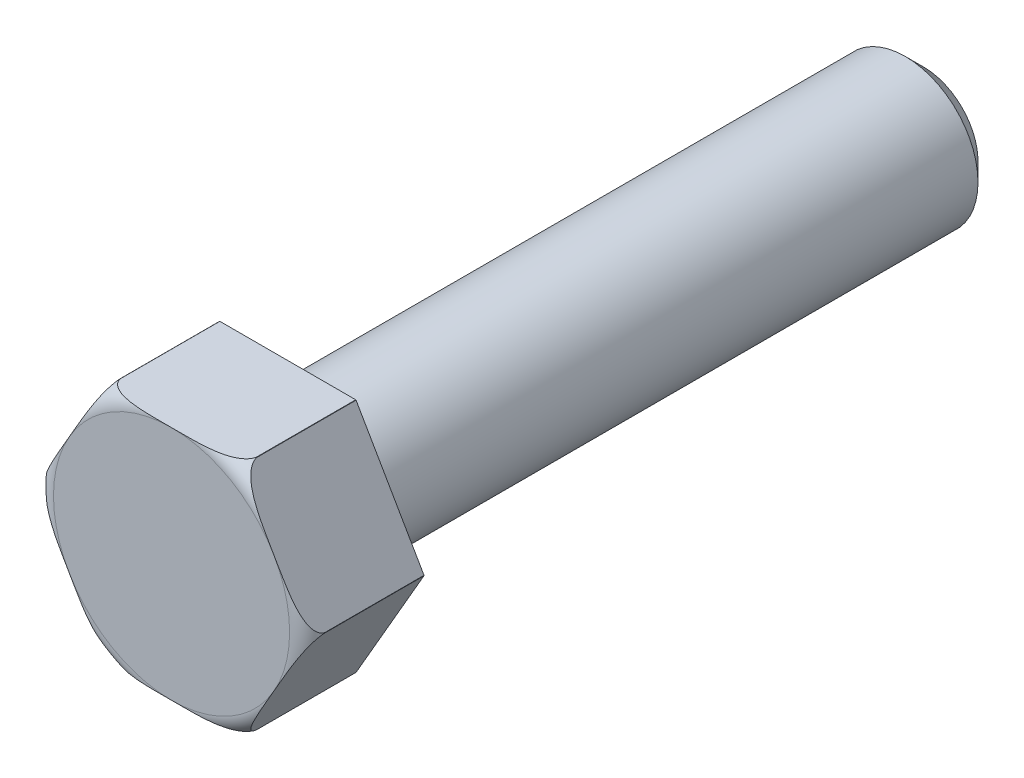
ISO-10303-21;
HEADER;
FILE_DESCRIPTION(('STEP AP214'),'2;1');
FILE_NAME('part.step','',(''),(''),'','','');
FILE_SCHEMA(('AUTOMOTIVE_DESIGN { 1 0 10303 214 1 1 1 1 }'));
ENDSEC;
DATA;
#1=APPLICATION_CONTEXT('core data for automotive mechanical design processes');
#2=APPLICATION_PROTOCOL_DEFINITION('international standard','automotive_design',2000,#1);
#3=PRODUCT_CONTEXT('',#1,'mechanical');
#4=PRODUCT('Part','Part','',(#3));
#5=PRODUCT_RELATED_PRODUCT_CATEGORY('part','',(#4));
#6=PRODUCT_DEFINITION_FORMATION('','',#4);
#7=PRODUCT_DEFINITION_CONTEXT('part definition',#1,'design');
#8=PRODUCT_DEFINITION('design','',#6,#7);
#9=PRODUCT_DEFINITION_SHAPE('','',#8);
#10=(LENGTH_UNIT() NAMED_UNIT(*) SI_UNIT(.MILLI.,.METRE.));
#11=(NAMED_UNIT(*) PLANE_ANGLE_UNIT() SI_UNIT($,.RADIAN.));
#12=(NAMED_UNIT(*) SI_UNIT($,.STERADIAN.) SOLID_ANGLE_UNIT());
#13=UNCERTAINTY_MEASURE_WITH_UNIT(LENGTH_MEASURE(1.E-05),#10,'distance_accuracy_value','');
#14=(GEOMETRIC_REPRESENTATION_CONTEXT(3) GLOBAL_UNCERTAINTY_ASSIGNED_CONTEXT((#13)) GLOBAL_UNIT_ASSIGNED_CONTEXT((#10,
#11,#12)) REPRESENTATION_CONTEXT('',''));
#15=CARTESIAN_POINT('',(0.,0.,0.));
#16=DIRECTION('',(0.,0.,1.));
#17=DIRECTION('',(1.,0.,0.));
#18=AXIS2_PLACEMENT_3D('',#15,#16,#17);
#19=CARTESIAN_POINT('',(0.,0.,0.));
#20=DIRECTION('',(0.,0.,1.));
#21=DIRECTION('',(1.,0.,0.));
#22=AXIS2_PLACEMENT_3D('',#19,#20,#21);
#23=PLANE('',#22);
#24=DIRECTION('',(0.5,0.866025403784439,0.));
#25=VECTOR('',#24,1.);
#26=CARTESIAN_POINT('',(3.75277674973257,-6.5,0.));
#27=LINE('',#26,#25);
#28=CARTESIAN_POINT('',(3.75833643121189,-6.49037034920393,0.));
#29=VERTEX_POINT('',#28);
#30=CARTESIAN_POINT('',(7.49999381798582,-0.009629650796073,0.));
#31=VERTEX_POINT('',#30);
#32=EDGE_CURVE('E347',#29,#31,#27,.T.);
#33=ORIENTED_EDGE('',*,*,#32,.F.);
#34=CARTESIAN_POINT('',(0.,0.,0.));
#35=DIRECTION('',(0.,0.,1.));
#36=DIRECTION('',(1.,0.,0.));
#37=AXIS2_PLACEMENT_3D('',#34,#35,#36);
#38=CIRCLE('',#37,7.5);
#39=CARTESIAN_POINT('',(3.74165738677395,-6.5,0.));
#40=VERTEX_POINT('',#39);
#41=EDGE_CURVE('E319',#40,#29,#38,.T.);
#42=ORIENTED_EDGE('',*,*,#41,.F.);
#43=DIRECTION('',(1.,0.,0.));
#44=VECTOR('',#43,1.);
#45=CARTESIAN_POINT('',(-3.75277674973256,-6.5,0.));
#46=LINE('',#45,#44);
#47=CARTESIAN_POINT('',(-3.74165738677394,-6.5,0.));
#48=VERTEX_POINT('',#47);
#49=EDGE_CURVE('E338',#48,#40,#46,.T.);
#50=ORIENTED_EDGE('',*,*,#49,.F.);
#51=CARTESIAN_POINT('',(-3.75833643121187,-6.49037034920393,0.));
#52=VERTEX_POINT('',#51);
#53=EDGE_CURVE('E324',#52,#48,#38,.T.);
#54=ORIENTED_EDGE('',*,*,#53,.F.);
#55=DIRECTION('',(0.5,-0.866025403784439,0.));
#56=VECTOR('',#55,1.);
#57=CARTESIAN_POINT('',(-7.50555349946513,0.,0.));
#58=LINE('',#57,#56);
#59=CARTESIAN_POINT('',(-7.49999381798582,-0.00962965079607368,0.));
#60=VERTEX_POINT('',#59);
#61=EDGE_CURVE('E336',#60,#52,#58,.T.);
#62=ORIENTED_EDGE('',*,*,#61,.F.);
#63=CARTESIAN_POINT('',(-7.49999381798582,0.00962965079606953,0.));
#64=VERTEX_POINT('',#63);
#65=EDGE_CURVE('E327',#64,#60,#38,.T.);
#66=ORIENTED_EDGE('',*,*,#65,.F.);
#67=DIRECTION('',(-0.5,-0.866025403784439,0.));
#68=VECTOR('',#67,1.);
#69=CARTESIAN_POINT('',(-3.75277674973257,6.5,0.));
#70=LINE('',#69,#68);
#71=CARTESIAN_POINT('',(-3.75833643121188,6.49037034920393,0.));
#72=VERTEX_POINT('',#71);
#73=EDGE_CURVE('E341',#72,#64,#70,.T.);
#74=ORIENTED_EDGE('',*,*,#73,.F.);
#75=CARTESIAN_POINT('',(-3.74165738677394,6.5,0.));
#76=VERTEX_POINT('',#75);
#77=EDGE_CURVE('E325',#76,#72,#38,.T.);
#78=ORIENTED_EDGE('',*,*,#77,.F.);
#79=DIRECTION('',(-1.,0.,0.));
#80=VECTOR('',#79,1.);
#81=CARTESIAN_POINT('',(3.75277674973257,6.5,0.));
#82=LINE('',#81,#80);
#83=CARTESIAN_POINT('',(3.74165738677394,6.5,0.));
#84=VERTEX_POINT('',#83);
#85=EDGE_CURVE('E346',#84,#76,#82,.T.);
#86=ORIENTED_EDGE('',*,*,#85,.F.);
#87=CARTESIAN_POINT('',(3.75833643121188,6.49037034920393,0.));
#88=VERTEX_POINT('',#87);
#89=EDGE_CURVE('E163',#88,#84,#38,.T.);
#90=ORIENTED_EDGE('',*,*,#89,.F.);
#91=DIRECTION('',(-0.5,0.866025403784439,0.));
#92=VECTOR('',#91,1.);
#93=CARTESIAN_POINT('',(7.50555349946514,0.,0.));
#94=LINE('',#93,#92);
#95=CARTESIAN_POINT('',(7.49999381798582,0.00962965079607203,0.));
#96=VERTEX_POINT('',#95);
#97=EDGE_CURVE('E345',#96,#88,#94,.T.);
#98=ORIENTED_EDGE('',*,*,#97,.F.);
#99=EDGE_CURVE('E317',#31,#96,#38,.T.);
#100=ORIENTED_EDGE('',*,*,#99,.F.);
#101=EDGE_LOOP('',(#33,#42,#50,#54,#62,#66,#74,#78,#86,#90,#98,#100));
#102=FACE_BOUND('',#101,.T.);
#103=CARTESIAN_POINT('',(0.,0.,0.));
#104=DIRECTION('',(0.,0.,1.));
#105=DIRECTION('',(1.,0.,0.));
#106=AXIS2_PLACEMENT_3D('',#103,#104,#105);
#107=CIRCLE('',#106,4.);
#108=CARTESIAN_POINT('',(4.,0.,0.));
#109=VERTEX_POINT('',#108);
#110=EDGE_CURVE('E223',#109,#109,#107,.F.);
#111=ORIENTED_EDGE('',*,*,#110,.F.);
#112=EDGE_LOOP('',(#111));
#113=FACE_BOUND('',#112,.T.);
#114=ADVANCED_FACE('F24',(#102,#113),#23,.F.);
#115=CARTESIAN_POINT('',(0.,0.,6.4));
#116=DIRECTION('',(0.,0.,-1.));
#117=DIRECTION('',(-1.,0.,0.));
#118=AXIS2_PLACEMENT_3D('',#115,#116,#117);
#119=CYLINDRICAL_SURFACE('',#118,7.5);
#120=DIRECTION('',(0.,0.,-1.));
#121=VECTOR('',#120,1.);
#122=CARTESIAN_POINT('',(3.75833643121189,-6.49037034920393,6.4));
#123=LINE('',#122,#121);
#124=CARTESIAN_POINT('',(3.75833643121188,-6.49037034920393,5.4));
#125=VERTEX_POINT('',#124);
#126=EDGE_CURVE('E316',#125,#29,#123,.T.);
#127=ORIENTED_EDGE('',*,*,#126,.F.);
#128=CARTESIAN_POINT('',(0.,0.,5.4));
#129=DIRECTION('',(0.,0.,1.));
#130=DIRECTION('',(1.,0.,0.));
#131=AXIS2_PLACEMENT_3D('',#128,#129,#130);
#132=CIRCLE('',#131,7.5);
#133=CARTESIAN_POINT('',(3.74165738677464,-6.5,5.40000000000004));
#134=VERTEX_POINT('',#133);
#135=EDGE_CURVE('E141',#125,#134,#132,.F.);
#136=ORIENTED_EDGE('',*,*,#135,.T.);
#137=DIRECTION('',(0.,0.,-1.));
#138=VECTOR('',#137,1.);
#139=CARTESIAN_POINT('',(3.74165738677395,-6.5,6.4));
#140=LINE('',#139,#138);
#141=EDGE_CURVE('E310',#40,#134,#140,.F.);
#142=ORIENTED_EDGE('',*,*,#141,.F.);
#143=ORIENTED_EDGE('',*,*,#41,.T.);
#144=EDGE_LOOP('',(#127,#136,#142,#143));
#145=FACE_BOUND('',#144,.T.);
#146=ADVANCED_FACE('F26',(#145),#119,.T.);
#147=DIRECTION('',(0.,0.,-1.));
#148=VECTOR('',#147,1.);
#149=CARTESIAN_POINT('',(7.49999381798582,-0.00962965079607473,6.4));
#150=LINE('',#149,#148);
#151=CARTESIAN_POINT('',(7.49999381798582,-0.00962965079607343,5.4));
#152=VERTEX_POINT('',#151);
#153=EDGE_CURVE('E314',#31,#152,#150,.F.);
#154=ORIENTED_EDGE('',*,*,#153,.F.);
#155=ORIENTED_EDGE('',*,*,#99,.T.);
#156=DIRECTION('',(0.,0.,-1.));
#157=VECTOR('',#156,1.);
#158=CARTESIAN_POINT('',(7.49999381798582,0.00962965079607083,6.4));
#159=LINE('',#158,#157);
#160=CARTESIAN_POINT('',(7.49999381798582,0.00962965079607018,5.4));
#161=VERTEX_POINT('',#160);
#162=EDGE_CURVE('E301',#161,#96,#159,.T.);
#163=ORIENTED_EDGE('',*,*,#162,.F.);
#164=EDGE_CURVE('E152',#161,#152,#132,.F.);
#165=ORIENTED_EDGE('',*,*,#164,.T.);
#166=EDGE_LOOP('',(#154,#155,#163,#165));
#167=FACE_BOUND('',#166,.T.);
#168=ADVANCED_FACE('F245',(#167),#119,.T.);
#169=DIRECTION('',(0.,0.,-1.));
#170=VECTOR('',#169,1.);
#171=CARTESIAN_POINT('',(-3.74165738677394,-6.5,6.4));
#172=LINE('',#171,#170);
#173=CARTESIAN_POINT('',(-3.74165738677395,-6.5,5.40000000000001));
#174=VERTEX_POINT('',#173);
#175=EDGE_CURVE('E312',#174,#48,#172,.T.);
#176=ORIENTED_EDGE('',*,*,#175,.F.);
#177=CARTESIAN_POINT('',(-3.75833643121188,-6.49037034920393,5.4));
#178=VERTEX_POINT('',#177);
#179=EDGE_CURVE('E273',#174,#178,#132,.F.);
#180=ORIENTED_EDGE('',*,*,#179,.T.);
#181=DIRECTION('',(0.,0.,-1.));
#182=VECTOR('',#181,1.);
#183=CARTESIAN_POINT('',(-3.75833643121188,-6.49037034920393,6.4));
#184=LINE('',#183,#182);
#185=EDGE_CURVE('E306',#52,#178,#184,.F.);
#186=ORIENTED_EDGE('',*,*,#185,.F.);
#187=ORIENTED_EDGE('',*,*,#53,.T.);
#188=EDGE_LOOP('',(#176,#180,#186,#187));
#189=FACE_BOUND('',#188,.T.);
#190=ADVANCED_FACE('F333',(#189),#119,.T.);
#191=DIRECTION('',(0.,0.,-1.));
#192=VECTOR('',#191,1.);
#193=CARTESIAN_POINT('',(-7.49999381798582,-0.00962965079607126,6.4));
#194=LINE('',#193,#192);
#195=CARTESIAN_POINT('',(-7.49999381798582,-0.00962965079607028,5.4));
#196=VERTEX_POINT('',#195);
#197=EDGE_CURVE('E308',#196,#60,#194,.T.);
#198=ORIENTED_EDGE('',*,*,#197,.F.);
#199=CARTESIAN_POINT('',(-7.49999381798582,0.00962965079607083,5.4));
#200=VERTEX_POINT('',#199);
#201=EDGE_CURVE('E275',#196,#200,#132,.F.);
#202=ORIENTED_EDGE('',*,*,#201,.T.);
#203=DIRECTION('',(0.,0.,-1.));
#204=VECTOR('',#203,1.);
#205=CARTESIAN_POINT('',(-7.49999381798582,0.00962965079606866,6.4));
#206=LINE('',#205,#204);
#207=EDGE_CURVE('E296',#64,#200,#206,.F.);
#208=ORIENTED_EDGE('',*,*,#207,.F.);
#209=ORIENTED_EDGE('',*,*,#65,.T.);
#210=EDGE_LOOP('',(#198,#202,#208,#209));
#211=FACE_BOUND('',#210,.T.);
#212=ADVANCED_FACE('F355',(#211),#119,.T.);
#213=DIRECTION('',(0.,0.,-1.));
#214=VECTOR('',#213,1.);
#215=CARTESIAN_POINT('',(-3.75833643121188,6.49037034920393,6.4));
#216=LINE('',#215,#214);
#217=CARTESIAN_POINT('',(-3.75833643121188,6.49037034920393,5.4));
#218=VERTEX_POINT('',#217);
#219=EDGE_CURVE('E299',#218,#72,#216,.T.);
#220=ORIENTED_EDGE('',*,*,#219,.F.);
#221=CARTESIAN_POINT('',(-3.74165738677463,6.5,5.40000000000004));
#222=VERTEX_POINT('',#221);
#223=EDGE_CURVE('E281',#218,#222,#132,.F.);
#224=ORIENTED_EDGE('',*,*,#223,.T.);
#225=DIRECTION('',(0.,0.,-1.));
#226=VECTOR('',#225,1.);
#227=CARTESIAN_POINT('',(-3.74165738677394,6.5,6.4));
#228=LINE('',#227,#226);
#229=EDGE_CURVE('E297',#76,#222,#228,.F.);
#230=ORIENTED_EDGE('',*,*,#229,.F.);
#231=ORIENTED_EDGE('',*,*,#77,.T.);
#232=EDGE_LOOP('',(#220,#224,#230,#231));
#233=FACE_BOUND('',#232,.T.);
#234=ADVANCED_FACE('F267',(#233),#119,.T.);
#235=DIRECTION('',(0.,0.,-1.));
#236=VECTOR('',#235,1.);
#237=CARTESIAN_POINT('',(3.74165738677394,6.5,6.4));
#238=LINE('',#237,#236);
#239=CARTESIAN_POINT('',(3.74165738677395,6.5,5.40000000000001));
#240=VERTEX_POINT('',#239);
#241=EDGE_CURVE('E294',#240,#84,#238,.T.);
#242=ORIENTED_EDGE('',*,*,#241,.F.);
#243=CARTESIAN_POINT('',(3.75833643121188,6.49037034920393,5.4));
#244=VERTEX_POINT('',#243);
#245=EDGE_CURVE('E169',#240,#244,#132,.F.);
#246=ORIENTED_EDGE('',*,*,#245,.T.);
#247=DIRECTION('',(0.,0.,-1.));
#248=VECTOR('',#247,1.);
#249=CARTESIAN_POINT('',(3.75833643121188,6.49037034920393,6.4));
#250=LINE('',#249,#248);
#251=EDGE_CURVE('E136',#88,#244,#250,.F.);
#252=ORIENTED_EDGE('',*,*,#251,.F.);
#253=ORIENTED_EDGE('',*,*,#89,.T.);
#254=EDGE_LOOP('',(#242,#246,#252,#253));
#255=FACE_BOUND('',#254,.T.);
#256=ADVANCED_FACE('F247',(#255),#119,.T.);
#257=CARTESIAN_POINT('',(0.,0.,5.4));
#258=DIRECTION('',(0.,0.,1.));
#259=DIRECTION('',(1.,0.,0.));
#260=AXIS2_PLACEMENT_3D('',#257,#258,#259);
#261=TOROIDAL_SURFACE('',#260,6.5,1.);
#262=ORIENTED_EDGE('',*,*,#135,.F.);
#263=CARTESIAN_POINT('',(3.75833645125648,-6.49037031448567,5.3998));
#264=CARTESIAN_POINT('',(3.7582954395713,-6.49044134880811,5.42969192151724));
#265=CARTESIAN_POINT('',(3.7596655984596,-6.48806816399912,5.45950977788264));
#266=CARTESIAN_POINT('',(3.76492333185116,-6.47896150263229,5.51799183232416));
#267=CARTESIAN_POINT('',(3.76878919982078,-6.47226562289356,5.54666373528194));
#268=CARTESIAN_POINT('',(3.77872848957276,-6.45505026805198,5.60230843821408));
#269=CARTESIAN_POINT('',(3.78479564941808,-6.44454163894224,5.62928580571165));
#270=CARTESIAN_POINT('',(3.79875458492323,-6.42036405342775,5.68132347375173));
#271=CARTESIAN_POINT('',(3.80665048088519,-6.40668796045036,5.70637927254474));
#272=CARTESIAN_POINT('',(3.82957976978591,-6.36697326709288,5.7702306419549));
#273=CARTESIAN_POINT('',(3.84588679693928,-6.33872866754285,5.80719392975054));
#274=CARTESIAN_POINT('',(3.88114998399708,-6.27765103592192,5.87565234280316));
#275=CARTESIAN_POINT('',(3.90011326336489,-6.24480567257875,5.90713224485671));
#276=CARTESIAN_POINT('',(3.93713070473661,-6.18068958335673,5.96137709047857));
#277=CARTESIAN_POINT('',(3.95496824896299,-6.14979405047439,5.98474443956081));
#278=CARTESIAN_POINT('',(3.99158827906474,-6.08636629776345,6.02832705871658));
#279=CARTESIAN_POINT('',(4.01037150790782,-6.05383279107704,6.04853979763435));
#280=CARTESIAN_POINT('',(4.06776619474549,-5.95442227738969,6.10511927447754));
#281=CARTESIAN_POINT('',(4.10738993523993,-5.8857919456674,6.13738252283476));
#282=CARTESIAN_POINT('',(4.17609838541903,-5.76678541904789,6.18528071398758));
#283=CARTESIAN_POINT('',(4.20484118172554,-5.71700143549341,6.20301279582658));
#284=CARTESIAN_POINT('',(4.26280490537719,-5.61660532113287,6.23505025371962));
#285=CARTESIAN_POINT('',(4.29202588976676,-5.56599309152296,6.2493552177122));
#286=CARTESIAN_POINT('',(4.38025645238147,-5.4131732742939,6.28806243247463));
#287=CARTESIAN_POINT('',(4.4397300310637,-5.31016201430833,6.3081901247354));
#288=CARTESIAN_POINT('',(4.55944259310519,-5.10281377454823,6.34062244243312));
#289=CARTESIAN_POINT('',(4.61968385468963,-4.99847284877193,6.35289006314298));
#290=CARTESIAN_POINT('',(4.740392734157,-4.78939893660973,6.37198037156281));
#291=CARTESIAN_POINT('',(4.80086043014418,-4.68466581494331,6.37880096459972));
#292=CARTESIAN_POINT('',(4.93366984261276,-4.45463316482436,6.38991080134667));
#293=CARTESIAN_POINT('',(5.00602538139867,-4.32930969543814,6.39344604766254));
#294=CARTESIAN_POINT('',(5.15076843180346,-4.07860737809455,6.39794650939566));
#295=CARTESIAN_POINT('',(5.22315594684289,-3.95322852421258,6.39891105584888));
#296=CARTESIAN_POINT('',(5.36768704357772,-3.70289332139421,6.39992016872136));
#297=CARTESIAN_POINT('',(5.43983062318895,-3.57793697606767,6.3999678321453));
#298=CARTESIAN_POINT('',(5.58411072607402,-3.32803650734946,6.40001432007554));
#299=CARTESIAN_POINT('',(5.65624724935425,-3.20309238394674,6.40001314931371));
#300=CARTESIAN_POINT('',(5.77725390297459,-2.99350271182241,6.39998339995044));
#301=CARTESIAN_POINT('',(5.82612402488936,-2.90885717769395,6.39996378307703));
#302=CARTESIAN_POINT('',(5.92386406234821,-2.73956646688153,6.3996914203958));
#303=CARTESIAN_POINT('',(5.9727339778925,-2.65492129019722,6.39943867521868));
#304=CARTESIAN_POINT('',(6.07047834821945,-2.48562307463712,6.39833071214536));
#305=CARTESIAN_POINT('',(6.11935280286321,-2.4009700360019,6.39747542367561));
#306=CARTESIAN_POINT('',(6.21709267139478,-2.23167961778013,6.39462289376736));
#307=CARTESIAN_POINT('',(6.26595808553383,-2.14704223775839,6.39262569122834));
#308=CARTESIAN_POINT('',(6.3809829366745,-1.94781335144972,6.3857651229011));
#309=CARTESIAN_POINT('',(6.44713232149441,-1.8332392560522,6.38013670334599));
#310=CARTESIAN_POINT('',(6.57939880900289,-1.60414697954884,6.36326703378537));
#311=CARTESIAN_POINT('',(6.64551563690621,-1.489629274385,6.35201565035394));
#312=CARTESIAN_POINT('',(6.74872964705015,-1.31085736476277,6.32756832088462));
#313=CARTESIAN_POINT('',(6.78599859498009,-1.24630565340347,6.317322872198));
#314=CARTESIAN_POINT('',(6.86024709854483,-1.11770347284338,6.29330001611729));
#315=CARTESIAN_POINT('',(6.89722673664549,-1.05365286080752,6.27952365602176));
#316=CARTESIAN_POINT('',(6.97059559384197,-0.926574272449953,6.24759755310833));
#317=CARTESIAN_POINT('',(7.00698632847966,-0.86354367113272,6.22946200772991));
#318=CARTESIAN_POINT('',(7.07895548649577,-0.738889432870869,6.18768079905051));
#319=CARTESIAN_POINT('',(7.11453467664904,-0.677264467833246,6.16404059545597));
#320=CARTESIAN_POINT('',(7.17493769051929,-0.572643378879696,6.11708077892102));
#321=CARTESIAN_POINT('',(7.20007575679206,-0.529102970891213,6.09539206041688));
#322=CARTESIAN_POINT('',(7.24931466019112,-0.443818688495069,6.04749850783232));
#323=CARTESIAN_POINT('',(7.27341411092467,-0.402077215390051,6.0212878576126));
#324=CARTESIAN_POINT('',(7.32017703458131,-0.321081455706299,5.96322713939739));
#325=CARTESIAN_POINT('',(7.34282585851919,-0.2818525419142,5.93132906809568));
#326=CARTESIAN_POINT('',(7.3854625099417,-0.208003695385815,5.86104326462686));
#327=CARTESIAN_POINT('',(7.40545727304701,-0.173371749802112,5.82267306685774));
#328=CARTESIAN_POINT('',(7.43421809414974,-0.123556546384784,5.75514020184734));
#329=CARTESIAN_POINT('',(7.44431538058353,-0.10606753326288,5.72825466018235));
#330=CARTESIAN_POINT('',(7.4624498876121,-0.0746576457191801,5.67180145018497));
#331=CARTESIAN_POINT('',(7.47048849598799,-0.0607343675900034,5.64223560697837));
#332=CARTESIAN_POINT('',(7.48317492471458,-0.0387608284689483,5.58428366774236));
#333=CARTESIAN_POINT('',(7.48810469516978,-0.0302222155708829,5.55614685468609));
#334=CARTESIAN_POINT('',(7.49552353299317,-0.0173724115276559,5.49864560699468));
#335=CARTESIAN_POINT('',(7.49801848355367,-0.0130510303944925,5.4692843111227));
#336=CARTESIAN_POINT('',(7.49973438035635,-0.0100790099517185,5.42644955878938));
#337=CARTESIAN_POINT('',(7.50000139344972,-0.00961652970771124,5.41312228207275));
#338=CARTESIAN_POINT('',(7.49999379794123,-0.00962968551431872,5.3998));
#339=B_SPLINE_CURVE_WITH_KNOTS('',3,(#263,#264,#265,#266,#267,#268,#269,#270,#271,#272,#273,
#274,#275,#276,#277,#278,#279,#280,#281,#282,#283,#284,#285,#286,#287,#288,#289,#290,#291,#292,
#293,#294,#295,#296,#297,#298,#299,#300,#301,#302,#303,#304,#305,#306,#307,#308,#309,#310,#311,
#312,#313,#314,#315,#316,#317,#318,#319,#320,#321,#322,#323,#324,#325,#326,#327,#328,#329,#330,
#331,#332,#333,#334,#335,#336,#337,#338),.UNSPECIFIED.,.F.,.F.,(4,2,2,2,2,2,2,2,2,2,2,2,2,2,2,2,
2,2,2,2,2,2,2,2,2,2,2,2,2,2,2,2,2,2,2,2,2,4),(0.,0.0894298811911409,0.178092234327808,
0.266504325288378,0.355117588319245,0.502152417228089,0.649589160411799,0.777342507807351,
0.905197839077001,1.16114386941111,1.34153259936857,1.52194300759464,1.88341378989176,
2.2465740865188,2.60987397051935,3.04408947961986,3.47841797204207,3.91127915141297,
4.34409838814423,4.63731907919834,4.93053897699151,5.22379322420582,5.51703748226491,
5.91423437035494,6.31214966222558,6.53780198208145,6.76338744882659,6.98824793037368,
7.21288633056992,7.37697926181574,7.54128484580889,7.70704921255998,7.87237149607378,
7.97296385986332,8.07348823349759,8.16256121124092,8.25141842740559,8.29138956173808),.UNSPECIFIED.);
#340=CARTESIAN_POINT('',(5.6291599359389,-3.25000898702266,6.4));
#341=VERTEX_POINT('',#340);
#342=EDGE_CURVE('E219',#125,#341,#339,.T.);
#343=ORIENTED_EDGE('',*,*,#342,.T.);
#344=CARTESIAN_POINT('',(0.,0.,6.4));
#345=DIRECTION('',(0.,0.,1.));
#346=DIRECTION('',(1.,0.,0.));
#347=AXIS2_PLACEMENT_3D('',#344,#345,#346);
#348=CIRCLE('',#347,6.5);
#349=CARTESIAN_POINT('',(0.,-6.5,6.4));
#350=VERTEX_POINT('',#349);
#351=EDGE_CURVE('E162',#350,#341,#348,.T.);
#352=ORIENTED_EDGE('',*,*,#351,.F.);
#353=CARTESIAN_POINT('',(0.,-6.5,6.4000000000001));
#354=CARTESIAN_POINT('',(0.166934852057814,-6.5,6.40000781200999));
#355=CARTESIAN_POINT('',(0.333870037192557,-6.5,6.40006491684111));
#356=CARTESIAN_POINT('',(0.667871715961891,-6.5,6.39956374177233));
#357=CARTESIAN_POINT('',(0.834938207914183,-6.5,6.39900497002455));
#358=CARTESIAN_POINT('',(1.16857920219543,-6.5,6.39509716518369));
#359=CARTESIAN_POINT('',(1.33515372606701,-6.5,6.39175622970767));
#360=CARTESIAN_POINT('',(1.58479198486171,-6.5,6.38197963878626));
#361=CARTESIAN_POINT('',(1.66794284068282,-6.5,6.37792848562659));
#362=CARTESIAN_POINT('',(1.8341055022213,-6.5,6.36763545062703));
#363=CARTESIAN_POINT('',(1.91711732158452,-6.5,6.36139379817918));
#364=CARTESIAN_POINT('',(2.08365163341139,-6.5,6.34595021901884));
#365=CARTESIAN_POINT('',(2.16717171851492,-6.5,6.33672136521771));
#366=CARTESIAN_POINT('',(2.33375315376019,-6.5,6.31443252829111));
#367=CARTESIAN_POINT('',(2.41681427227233,-6.5,6.30137076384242));
#368=CARTESIAN_POINT('',(2.58199432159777,-6.5,6.27032025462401));
#369=CARTESIAN_POINT('',(2.66411374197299,-6.5,6.25233420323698));
#370=CARTESIAN_POINT('',(2.82664882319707,-6.5,6.21003204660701));
#371=CARTESIAN_POINT('',(2.90706613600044,-6.5,6.18572241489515));
#372=CARTESIAN_POINT('',(3.06563052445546,-6.5,6.1286477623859));
#373=CARTESIAN_POINT('',(3.14375806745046,-6.5,6.09582546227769));
#374=CARTESIAN_POINT('',(3.25665293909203,-6.5,6.0383970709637));
#375=CARTESIAN_POINT('',(3.29351994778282,-6.5,6.01792276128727));
#376=CARTESIAN_POINT('',(3.36530081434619,-6.5,5.97382042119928));
#377=CARTESIAN_POINT('',(3.40021642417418,-6.5,5.95019528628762));
#378=CARTESIAN_POINT('',(3.4667579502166,-6.5,5.89977611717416));
#379=CARTESIAN_POINT('',(3.49843069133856,-6.5,5.87304467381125));
#380=CARTESIAN_POINT('',(3.55807833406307,-6.5,5.81567322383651));
#381=CARTESIAN_POINT('',(3.5860546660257,-6.5,5.78503473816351));
#382=CARTESIAN_POINT('',(3.63294992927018,-6.5,5.72453574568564));
#383=CARTESIAN_POINT('',(3.65259796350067,-6.5,5.69524740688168));
#384=CARTESIAN_POINT('',(3.68684776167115,-6.5,5.63384431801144));
#385=CARTESIAN_POINT('',(3.70145748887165,-6.5,5.60173412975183));
#386=CARTESIAN_POINT('',(3.72232433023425,-6.5,5.54120083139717));
#387=CARTESIAN_POINT('',(3.72960256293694,-6.5,5.51313208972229));
#388=CARTESIAN_POINT('',(3.73931303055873,-6.5,5.45616644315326));
#389=CARTESIAN_POINT('',(3.74174823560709,-6.5,5.4272700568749));
#390=CARTESIAN_POINT('',(3.74156119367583,-6.5,5.36946404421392));
#391=CARTESIAN_POINT('',(3.73893357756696,-6.5,5.34055443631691));
#392=CARTESIAN_POINT('',(3.72884263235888,-6.5,5.2835939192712));
#393=CARTESIAN_POINT('',(3.72137683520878,-6.5,5.2555434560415));
#394=CARTESIAN_POINT('',(3.70217615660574,-6.5,5.20092239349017));
#395=CARTESIAN_POINT('',(3.69043491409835,-6.5,5.17435406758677));
#396=CARTESIAN_POINT('',(3.6634160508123,-6.5,5.12310394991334));
#397=CARTESIAN_POINT('',(3.64813714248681,-6.5,5.09842284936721));
#398=CARTESIAN_POINT('',(3.60351406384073,-6.5,5.03514635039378));
#399=CARTESIAN_POINT('',(3.57161941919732,-6.5,4.99835110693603));
#400=CARTESIAN_POINT('',(3.50252219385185,-6.5,4.93011183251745));
#401=CARTESIAN_POINT('',(3.46530297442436,-6.5,4.89868528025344));
#402=CARTESIAN_POINT('',(3.39275783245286,-6.5,4.84461491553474));
#403=CARTESIAN_POINT('',(3.35788074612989,-6.5,4.82135755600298));
#404=CARTESIAN_POINT('',(3.28624204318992,-6.5,4.777928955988));
#405=CARTESIAN_POINT('',(3.24947896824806,-6.5,4.75776015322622));
#406=CARTESIAN_POINT('',(3.13712317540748,-6.5,4.70125001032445));
#407=CARTESIAN_POINT('',(3.05950395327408,-6.5,4.66893283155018));
#408=CARTESIAN_POINT('',(2.92567600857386,-6.5,4.62113726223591));
#409=CARTESIAN_POINT('',(2.87017860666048,-6.5,4.60353168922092));
#410=CARTESIAN_POINT('',(2.75823620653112,-6.5,4.57161258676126));
#411=CARTESIAN_POINT('',(2.70179110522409,-6.5,4.55729941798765));
#412=CARTESIAN_POINT('',(2.53132931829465,-6.5,4.5184242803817));
#413=CARTESIAN_POINT('',(2.41637963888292,-6.5,4.49799090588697));
#414=CARTESIAN_POINT('',(2.18480342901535,-6.5,4.46475266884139));
#415=CARTESIAN_POINT('',(2.06817106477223,-6.5,4.45199217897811));
#416=CARTESIAN_POINT('',(1.83457929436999,-6.5,4.43190387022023));
#417=CARTESIAN_POINT('',(1.7176203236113,-6.5,4.42457071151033));
#418=CARTESIAN_POINT('',(1.47081504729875,-6.5,4.4128896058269));
#419=CARTESIAN_POINT('',(1.34095132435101,-6.5,4.40895333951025));
#420=CARTESIAN_POINT('',(1.08116541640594,-6.5,4.40359819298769));
#421=CARTESIAN_POINT('',(0.951243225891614,-6.5,4.4021796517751));
#422=CARTESIAN_POINT('',(0.691298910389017,-6.5,4.40049276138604));
#423=CARTESIAN_POINT('',(0.56127678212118,-6.5,4.40022525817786));
#424=CARTESIAN_POINT('',(0.301242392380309,-6.5,4.39997897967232));
#425=CARTESIAN_POINT('',(0.171230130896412,-6.5,4.40000018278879));
#426=CARTESIAN_POINT('',(-0.0892040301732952,-6.5,4.39999983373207));
#427=CARTESIAN_POINT('',(-0.219625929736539,-6.5,4.39997814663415));
#428=CARTESIAN_POINT('',(-0.480478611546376,-6.5,4.40011057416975));
#429=CARTESIAN_POINT('',(-0.610909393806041,-6.5,4.40026470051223));
#430=CARTESIAN_POINT('',(-0.871662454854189,-6.5,4.40151128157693));
#431=CARTESIAN_POINT('',(-1.00198473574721,-6.5,4.40260297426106));
#432=CARTESIAN_POINT('',(-1.26258767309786,-6.5,4.40700134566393));
#433=CARTESIAN_POINT('',(-1.39286833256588,-6.5,4.41030777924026));
#434=CARTESIAN_POINT('',(-1.65539963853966,-6.5,4.42101923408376));
#435=CARTESIAN_POINT('',(-1.78764784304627,-6.5,4.42849007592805));
#436=CARTESIAN_POINT('',(-2.05189059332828,-6.5,4.45010158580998));
#437=CARTESIAN_POINT('',(-2.18388437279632,-6.5,4.46425312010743));
#438=CARTESIAN_POINT('',(-2.37996119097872,-6.5,4.49297655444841));
#439=CARTESIAN_POINT('',(-2.4446017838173,-6.5,4.50371017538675));
#440=CARTESIAN_POINT('',(-2.57329885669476,-6.5,4.5282107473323));
#441=CARTESIAN_POINT('',(-2.63735549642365,-6.5,4.54197684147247));
#442=CARTESIAN_POINT('',(-2.76439444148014,-6.5,4.57315756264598));
#443=CARTESIAN_POINT('',(-2.82737927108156,-6.5,4.59056177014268));
#444=CARTESIAN_POINT('',(-2.95191750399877,-6.5,4.62985066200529));
#445=CARTESIAN_POINT('',(-3.01347209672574,-6.5,4.65173146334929));
#446=CARTESIAN_POINT('',(-3.10194035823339,-6.5,4.68780847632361));
#447=CARTESIAN_POINT('',(-3.12973984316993,-6.5,4.69983870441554));
#448=CARTESIAN_POINT('',(-3.184731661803,-6.5,4.72521931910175));
#449=CARTESIAN_POINT('',(-3.2119238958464,-6.5,4.73856992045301));
#450=CARTESIAN_POINT('',(-3.29246118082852,-6.5,4.78085479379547));
#451=CARTESIAN_POINT('',(-3.34469936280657,-6.5,4.81199555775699));
#452=CARTESIAN_POINT('',(-3.43676113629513,-6.5,4.87615123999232));
#453=CARTESIAN_POINT('',(-3.47726851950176,-6.5,4.90817403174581));
#454=CARTESIAN_POINT('',(-3.55280322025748,-6.5,4.97815766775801));
#455=CARTESIAN_POINT('',(-3.58784550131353,-6.5,5.01610170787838));
#456=CARTESIAN_POINT('',(-3.6386342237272,-6.5,5.08381072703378));
#457=CARTESIAN_POINT('',(-3.6568247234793,-6.5,5.11173204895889));
#458=CARTESIAN_POINT('',(-3.68864126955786,-6.5,5.17008989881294));
#459=CARTESIAN_POINT('',(-3.70227077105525,-6.5,5.20052450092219));
#460=CARTESIAN_POINT('',(-3.72398035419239,-6.5,5.26370633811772));
#461=CARTESIAN_POINT('',(-3.73200209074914,-6.5,5.29647408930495));
#462=CARTESIAN_POINT('',(-3.7413924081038,-6.5,5.36294821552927));
#463=CARTESIAN_POINT('',(-3.74276729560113,-6.5,5.39665367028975));
#464=CARTESIAN_POINT('',(-3.73900350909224,-6.5,5.45902755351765));
#465=CARTESIAN_POINT('',(-3.73473254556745,-6.5,5.48775264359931));
#466=CARTESIAN_POINT('',(-3.7215168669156,-6.5,5.54409870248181));
#467=CARTESIAN_POINT('',(-3.7125701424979,-6.5,5.57171919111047));
#468=CARTESIAN_POINT('',(-3.68758192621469,-6.5,5.63277172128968));
#469=CARTESIAN_POINT('',(-3.67025750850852,-6.5,5.66567560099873));
#470=CARTESIAN_POINT('',(-3.63052861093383,-6.5,5.72825055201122));
#471=CARTESIAN_POINT('',(-3.60811407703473,-6.5,5.75791505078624));
#472=CARTESIAN_POINT('',(-3.54707858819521,-6.5,5.82836227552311));
#473=CARTESIAN_POINT('',(-3.50604420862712,-6.5,5.86703715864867));
#474=CARTESIAN_POINT('',(-3.41866828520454,-6.5,5.93774944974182));
#475=CARTESIAN_POINT('',(-3.3723159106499,-6.5,5.96977292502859));
#476=CARTESIAN_POINT('',(-3.28016840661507,-6.5,6.02585670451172));
#477=CARTESIAN_POINT('',(-3.23463312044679,-6.5,6.05035226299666));
#478=CARTESIAN_POINT('',(-3.14162091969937,-6.5,6.09538497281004));
#479=CARTESIAN_POINT('',(-3.09414222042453,-6.5,6.11591838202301));
#480=CARTESIAN_POINT('',(-2.99777800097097,-6.5,6.1536669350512));
#481=CARTESIAN_POINT('',(-2.94888957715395,-6.5,6.17087456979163));
#482=CARTESIAN_POINT('',(-2.85024315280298,-6.5,6.2024128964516));
#483=CARTESIAN_POINT('',(-2.80048577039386,-6.5,6.21674554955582));
#484=CARTESIAN_POINT('',(-2.63990889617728,-6.5,6.25883127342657));
#485=CARTESIAN_POINT('',(-2.52786427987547,-6.5,6.28190663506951));
#486=CARTESIAN_POINT('',(-2.30234841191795,-6.5,6.31975352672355));
#487=CARTESIAN_POINT('',(-2.18887549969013,-6.5,6.33451425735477));
#488=CARTESIAN_POINT('',(-1.96084170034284,-6.5,6.35819816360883));
#489=CARTESIAN_POINT('',(-1.84627822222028,-6.5,6.36709531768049));
#490=CARTESIAN_POINT('',(-1.61698664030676,-6.5,6.3808319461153));
#491=CARTESIAN_POINT('',(-1.50225864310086,-6.5,6.3856733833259));
#492=CARTESIAN_POINT('',(-1.27178392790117,-6.5,6.39279549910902));
#493=CARTESIAN_POINT('',(-1.15603661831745,-6.5,6.3950547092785));
#494=CARTESIAN_POINT('',(-0.924515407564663,-6.5,6.39809130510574));
#495=CARTESIAN_POINT('',(-0.808741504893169,-6.5,6.39886854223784));
#496=CARTESIAN_POINT('',(-0.577470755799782,-6.5,6.39977314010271));
#497=CARTESIAN_POINT('',(-0.461973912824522,-6.5,6.39990205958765));
#498=CARTESIAN_POINT('',(-0.23098476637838,-6.5,6.40001278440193));
#499=CARTESIAN_POINT('',(-0.115492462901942,-6.5,6.39999459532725));
#500=CARTESIAN_POINT('',(0.,-6.5,6.4000000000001));
#501=B_SPLINE_CURVE_WITH_KNOTS('',3,(#353,#354,#355,#356,#357,#358,#359,#360,#361,#362,#363,
#364,#365,#366,#367,#368,#369,#370,#371,#372,#373,#374,#375,#376,#377,#378,#379,#380,#381,#382,
#383,#384,#385,#386,#387,#388,#389,#390,#391,#392,#393,#394,#395,#396,#397,#398,#399,#400,#401,
#402,#403,#404,#405,#406,#407,#408,#409,#410,#411,#412,#413,#414,#415,#416,#417,#418,#419,#420,
#421,#422,#423,#424,#425,#426,#427,#428,#429,#430,#431,#432,#433,#434,#435,#436,#437,#438,#439,
#440,#441,#442,#443,#444,#445,#446,#447,#448,#449,#450,#451,#452,#453,#454,#455,#456,#457,#458,
#459,#460,#461,#462,#463,#464,#465,#466,#467,#468,#469,#470,#471,#472,#473,#474,#475,#476,#477,
#478,#479,#480,#481,#482,#483,#484,#485,#486,#487,#488,#489,#490,#491,#492,#493,#494,#495,#496,
#497,#498,#499,#500),.UNSPECIFIED.,.T.,.F.,(4,2,2,2,2,2,2,2,2,2,2,2,2,2,2,2,2,2,2,2,2,2,2,2,2,2,
2,2,2,2,2,2,2,2,2,2,2,2,2,2,2,2,2,2,2,2,2,2,2,2,2,2,2,2,2,2,2,2,2,2,2,2,2,2,2,2,2,2,2,2,2,2,2,
4),(0.,0.500804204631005,1.00200864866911,1.50175939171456,1.75148658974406,2.00118764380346,
2.25320533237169,2.50534033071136,2.75733769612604,3.00907809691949,3.26255843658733,
3.38894580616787,3.51521782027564,3.63928323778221,3.76330050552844,3.86872257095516,
3.97397724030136,4.06058811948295,4.14714586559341,4.23379545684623,4.32048928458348,
4.40731262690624,4.49416761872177,4.63941158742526,4.78511976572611,4.91069747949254,
5.03637380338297,5.28787139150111,5.46245913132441,5.63706598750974,5.98688826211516,
6.338714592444,6.69019430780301,7.07992144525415,7.46970105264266,7.85976708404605,
8.2498039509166,8.64106975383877,9.03236161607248,9.4233357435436,9.8142666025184,
10.2115590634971,10.6094999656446,10.8060214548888,11.0024874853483,11.1983983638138,
11.3941400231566,11.4849808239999,11.5758364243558,11.757764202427,11.9122355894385,
12.0662763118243,12.1659183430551,12.2654847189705,12.3660721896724,12.4665642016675,
12.5532698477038,12.6400127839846,12.7509531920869,12.8621146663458,13.0303291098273,
13.1988924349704,13.3537812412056,13.5088156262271,13.664196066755,13.8194701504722,
14.1621280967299,14.5052300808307,14.849844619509,15.1942922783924,15.5415832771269,
15.8889090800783,16.235399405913,16.5818765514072),.UNSPECIFIED.);
#502=EDGE_CURVE('E39',#350,#134,#501,.T.);
#503=ORIENTED_EDGE('',*,*,#502,.T.);
#504=EDGE_LOOP('',(#262,#343,#352,#503));
#505=FACE_BOUND('',#504,.T.);
#506=ADVANCED_FACE('F194',(#505),#261,.T.);
#507=CARTESIAN_POINT('',(5.62915785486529,3.25001259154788,6.4));
#508=VERTEX_POINT('',#507);
#509=EDGE_CURVE('E149',#341,#508,#348,.T.);
#510=ORIENTED_EDGE('',*,*,#509,.F.);
#511=EDGE_CURVE('E217',#341,#152,#339,.T.);
#512=ORIENTED_EDGE('',*,*,#511,.T.);
#513=ORIENTED_EDGE('',*,*,#164,.F.);
#514=CARTESIAN_POINT('',(7.49999379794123,0.00962968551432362,5.3998));
#515=CARTESIAN_POINT('',(7.50003480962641,0.00955865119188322,5.42969192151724));
#516=CARTESIAN_POINT('',(7.4986646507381,0.0119318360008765,5.45950977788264));
#517=CARTESIAN_POINT('',(7.49340691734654,0.0210384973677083,5.51799183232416));
#518=CARTESIAN_POINT('',(7.48954104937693,0.0277343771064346,5.54666373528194));
#519=CARTESIAN_POINT('',(7.47960175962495,0.0449497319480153,5.60230843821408));
#520=CARTESIAN_POINT('',(7.47353459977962,0.0554583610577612,5.62928580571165));
#521=CARTESIAN_POINT('',(7.45957566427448,0.0796359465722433,5.68132347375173));
#522=CARTESIAN_POINT('',(7.45167976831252,0.0933120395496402,5.70637927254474));
#523=CARTESIAN_POINT('',(7.4287504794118,0.133026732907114,5.7702306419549));
#524=CARTESIAN_POINT('',(7.41244345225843,0.161271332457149,5.80719392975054));
#525=CARTESIAN_POINT('',(7.37718026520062,0.222348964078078,5.87565234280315));
#526=CARTESIAN_POINT('',(7.35821698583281,0.255194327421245,5.90713224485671));
#527=CARTESIAN_POINT('',(7.3211995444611,0.319310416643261,5.96137709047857));
#528=CARTESIAN_POINT('',(7.30336200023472,0.350205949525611,5.98474443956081));
#529=CARTESIAN_POINT('',(7.26674197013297,0.413633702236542,6.02832705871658));
#530=CARTESIAN_POINT('',(7.24795874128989,0.44616720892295,6.04853979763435));
#531=CARTESIAN_POINT('',(7.19056405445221,0.545577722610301,6.10511927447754));
#532=CARTESIAN_POINT('',(7.15094031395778,0.614208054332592,6.13738252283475));
#533=CARTESIAN_POINT('',(7.08223186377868,0.733214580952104,6.18528071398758));
#534=CARTESIAN_POINT('',(7.05348906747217,0.782998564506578,6.20301279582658));
#535=CARTESIAN_POINT('',(6.99552534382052,0.883394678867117,6.23505025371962));
#536=CARTESIAN_POINT('',(6.96630435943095,0.934006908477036,6.2493552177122));
#537=CARTESIAN_POINT('',(6.87807379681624,1.08682672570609,6.28806243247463));
#538=CARTESIAN_POINT('',(6.81860021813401,1.18983798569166,6.3081901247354));
#539=CARTESIAN_POINT('',(6.69888765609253,1.39718622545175,6.34062244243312));
#540=CARTESIAN_POINT('',(6.63864639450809,1.50152715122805,6.35289006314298));
#541=CARTESIAN_POINT('',(6.51793751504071,1.71060106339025,6.37198037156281));
#542=CARTESIAN_POINT('',(6.45746981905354,1.81533418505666,6.37880096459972));
#543=CARTESIAN_POINT('',(6.32466040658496,2.04536683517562,6.38991080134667));
#544=CARTESIAN_POINT('',(6.25230486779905,2.17069030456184,6.39344604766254));
#545=CARTESIAN_POINT('',(6.10756181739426,2.42139262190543,6.39794650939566));
#546=CARTESIAN_POINT('',(6.03517430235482,2.5467714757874,6.39891105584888));
#547=CARTESIAN_POINT('',(5.89064320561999,2.79710667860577,6.39992016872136));
#548=CARTESIAN_POINT('',(5.81849962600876,2.92206302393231,6.3999678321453));
#549=CARTESIAN_POINT('',(5.67421952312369,3.17196349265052,6.40001432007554));
#550=CARTESIAN_POINT('',(5.60208299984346,3.29690761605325,6.40001314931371));
#551=CARTESIAN_POINT('',(5.48107634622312,3.50649728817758,6.39998339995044));
#552=CARTESIAN_POINT('',(5.43220622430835,3.59114282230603,6.39996378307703));
#553=CARTESIAN_POINT('',(5.3344661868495,3.76043353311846,6.3996914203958));
#554=CARTESIAN_POINT('',(5.28559627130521,3.84507870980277,6.39943867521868));
#555=CARTESIAN_POINT('',(5.18785190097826,4.01437692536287,6.39833071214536));
#556=CARTESIAN_POINT('',(5.1389774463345,4.09902996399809,6.39747542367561));
#557=CARTESIAN_POINT('',(5.04123757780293,4.26832038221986,6.39462289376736));
#558=CARTESIAN_POINT('',(4.99237216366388,4.3529577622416,6.39262569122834));
#559=CARTESIAN_POINT('',(4.87734731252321,4.55218664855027,6.3857651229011));
#560=CARTESIAN_POINT('',(4.8111979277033,4.66676074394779,6.38013670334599));
#561=CARTESIAN_POINT('',(4.67893144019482,4.89585302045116,6.36326703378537));
#562=CARTESIAN_POINT('',(4.61281461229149,5.010370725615,6.35201565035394));
#563=CARTESIAN_POINT('',(4.50960060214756,5.18914263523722,6.32756832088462));
#564=CARTESIAN_POINT('',(4.47233165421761,5.25369434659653,6.317322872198));
#565=CARTESIAN_POINT('',(4.39808315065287,5.38229652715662,6.29330001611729));
#566=CARTESIAN_POINT('',(4.36110351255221,5.44634713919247,6.27952365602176));
#567=CARTESIAN_POINT('',(4.28773465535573,5.57342572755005,6.24759755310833));
#568=CARTESIAN_POINT('',(4.25134392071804,5.63645632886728,6.22946200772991));
#569=CARTESIAN_POINT('',(4.17937476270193,5.76111056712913,6.18768079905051));
#570=CARTESIAN_POINT('',(4.14379557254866,5.82273553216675,6.16404059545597));
#571=CARTESIAN_POINT('',(4.08339255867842,5.9273566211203,6.11708077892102));
#572=CARTESIAN_POINT('',(4.05825449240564,5.97089702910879,6.09539206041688));
#573=CARTESIAN_POINT('',(4.00901558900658,6.05618131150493,6.04749850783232));
#574=CARTESIAN_POINT('',(3.98491613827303,6.09792278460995,6.0212878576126));
#575=CARTESIAN_POINT('',(3.93815321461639,6.1789185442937,5.96322713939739));
#576=CARTESIAN_POINT('',(3.91550439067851,6.2181474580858,5.93132906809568));
#577=CARTESIAN_POINT('',(3.872867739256,6.29199630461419,5.86104326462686));
#578=CARTESIAN_POINT('',(3.85287297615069,6.32662825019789,5.82267306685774));
#579=CARTESIAN_POINT('',(3.82411215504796,6.37644345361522,5.75514020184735));
#580=CARTESIAN_POINT('',(3.81401486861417,6.39393246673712,5.72825466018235));
#581=CARTESIAN_POINT('',(3.7958803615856,6.42534235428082,5.67180145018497));
#582=CARTESIAN_POINT('',(3.78784175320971,6.43926563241,5.64223560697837));
#583=CARTESIAN_POINT('',(3.77515532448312,6.46123917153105,5.58428366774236));
#584=CARTESIAN_POINT('',(3.77022555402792,6.46977778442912,5.5561468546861));
#585=CARTESIAN_POINT('',(3.76280671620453,6.48262758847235,5.49864560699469));
#586=CARTESIAN_POINT('',(3.76031176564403,6.48694896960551,5.4692843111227));
#587=CARTESIAN_POINT('',(3.75859586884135,6.48992099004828,5.42644955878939));
#588=CARTESIAN_POINT('',(3.75832885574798,6.49038347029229,5.41312228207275));
#589=CARTESIAN_POINT('',(3.75833645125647,6.49037031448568,5.3998));
#590=B_SPLINE_CURVE_WITH_KNOTS('',3,(#514,#515,#516,#517,#518,#519,#520,#521,#522,#523,#524,
#525,#526,#527,#528,#529,#530,#531,#532,#533,#534,#535,#536,#537,#538,#539,#540,#541,#542,#543,
#544,#545,#546,#547,#548,#549,#550,#551,#552,#553,#554,#555,#556,#557,#558,#559,#560,#561,#562,
#563,#564,#565,#566,#567,#568,#569,#570,#571,#572,#573,#574,#575,#576,#577,#578,#579,#580,#581,
#582,#583,#584,#585,#586,#587,#588,#589),.UNSPECIFIED.,.F.,.F.,(4,2,2,2,2,2,2,2,2,2,2,2,2,2,2,2,
2,2,2,2,2,2,2,2,2,2,2,2,2,2,2,2,2,2,2,2,2,4),(0.,0.0894298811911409,0.178092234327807,
0.266504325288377,0.355117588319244,0.502152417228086,0.649589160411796,0.777342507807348,
0.905197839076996,1.16114386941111,1.34153259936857,1.52194300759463,1.88341378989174,
2.24657408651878,2.60987397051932,3.04408947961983,3.47841797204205,3.91127915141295,
4.34409838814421,4.63731907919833,4.9305389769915,5.22379322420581,5.5170374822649,
5.91423437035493,6.31214966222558,6.53780198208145,6.76338744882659,6.98824793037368,
7.21288633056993,7.37697926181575,7.5412848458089,7.70704921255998,7.87237149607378,
7.97296385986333,8.07348823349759,8.16256121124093,8.2514184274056,8.29138956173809),.UNSPECIFIED.);
#591=EDGE_CURVE('E133',#161,#508,#590,.T.);
#592=ORIENTED_EDGE('',*,*,#591,.T.);
#593=EDGE_LOOP('',(#510,#512,#513,#592));
#594=FACE_BOUND('',#593,.T.);
#595=ADVANCED_FACE('F147',(#594),#261,.T.);
#596=ORIENTED_EDGE('',*,*,#179,.F.);
#597=EDGE_CURVE('E366',#174,#350,#501,.T.);
#598=ORIENTED_EDGE('',*,*,#597,.T.);
#599=CARTESIAN_POINT('',(-5.62916225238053,-3.25000497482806,6.4));
#600=VERTEX_POINT('',#599);
#601=EDGE_CURVE('E183',#600,#350,#348,.T.);
#602=ORIENTED_EDGE('',*,*,#601,.F.);
#603=CARTESIAN_POINT('',(-7.49999379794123,-0.00962968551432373,5.3998));
#604=CARTESIAN_POINT('',(-7.50003480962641,-0.00955865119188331,5.42969192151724));
#605=CARTESIAN_POINT('',(-7.4986646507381,-0.0119318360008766,5.45950977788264));
#606=CARTESIAN_POINT('',(-7.49340691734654,-0.0210384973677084,5.51799183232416));
#607=CARTESIAN_POINT('',(-7.48954104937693,-0.0277343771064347,5.54666373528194));
#608=CARTESIAN_POINT('',(-7.47960175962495,-0.0449497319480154,5.60230843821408));
#609=CARTESIAN_POINT('',(-7.47353459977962,-0.0554583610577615,5.62928580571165));
#610=CARTESIAN_POINT('',(-7.45957566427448,-0.0796359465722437,5.68132347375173));
#611=CARTESIAN_POINT('',(-7.45167976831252,-0.0933120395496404,5.70637927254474));
#612=CARTESIAN_POINT('',(-7.4287504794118,-0.133026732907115,5.7702306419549));
#613=CARTESIAN_POINT('',(-7.41244345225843,-0.161271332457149,5.80719392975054));
#614=CARTESIAN_POINT('',(-7.37718026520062,-0.222348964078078,5.87565234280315));
#615=CARTESIAN_POINT('',(-7.35821698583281,-0.255194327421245,5.90713224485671));
#616=CARTESIAN_POINT('',(-7.3211995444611,-0.31931041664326,5.96137709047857));
#617=CARTESIAN_POINT('',(-7.30336200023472,-0.35020594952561,5.98474443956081));
#618=CARTESIAN_POINT('',(-7.26674197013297,-0.413633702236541,6.02832705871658));
#619=CARTESIAN_POINT('',(-7.24795874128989,-0.446167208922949,6.04853979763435));
#620=CARTESIAN_POINT('',(-7.19056405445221,-0.545577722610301,6.10511927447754));
#621=CARTESIAN_POINT('',(-7.15094031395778,-0.614208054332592,6.13738252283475));
#622=CARTESIAN_POINT('',(-7.08223186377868,-0.733214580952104,6.18528071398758));
#623=CARTESIAN_POINT('',(-7.05348906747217,-0.782998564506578,6.20301279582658));
#624=CARTESIAN_POINT('',(-6.99552534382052,-0.883394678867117,6.23505025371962));
#625=CARTESIAN_POINT('',(-6.96630435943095,-0.934006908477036,6.2493552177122));
#626=CARTESIAN_POINT('',(-6.87807379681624,-1.08682672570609,6.28806243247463));
#627=CARTESIAN_POINT('',(-6.81860021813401,-1.18983798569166,6.3081901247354));
#628=CARTESIAN_POINT('',(-6.69888765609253,-1.39718622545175,6.34062244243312));
#629=CARTESIAN_POINT('',(-6.63864639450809,-1.50152715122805,6.35289006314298));
#630=CARTESIAN_POINT('',(-6.51793751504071,-1.71060106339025,6.37198037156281));
#631=CARTESIAN_POINT('',(-6.45746981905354,-1.81533418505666,6.37880096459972));
#632=CARTESIAN_POINT('',(-6.32466040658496,-2.04536683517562,6.38991080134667));
#633=CARTESIAN_POINT('',(-6.25230486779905,-2.17069030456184,6.39344604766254));
#634=CARTESIAN_POINT('',(-6.10756181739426,-2.42139262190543,6.39794650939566));
#635=CARTESIAN_POINT('',(-6.03517430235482,-2.5467714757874,6.39891105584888));
#636=CARTESIAN_POINT('',(-5.89064320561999,-2.79710667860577,6.39992016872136));
#637=CARTESIAN_POINT('',(-5.81849962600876,-2.92206302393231,6.3999678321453));
#638=CARTESIAN_POINT('',(-5.67421952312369,-3.17196349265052,6.40001432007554));
#639=CARTESIAN_POINT('',(-5.60208299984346,-3.29690761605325,6.40001314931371));
#640=CARTESIAN_POINT('',(-5.48107634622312,-3.50649728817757,6.39998339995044));
#641=CARTESIAN_POINT('',(-5.43220622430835,-3.59114282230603,6.39996378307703));
#642=CARTESIAN_POINT('',(-5.3344661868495,-3.76043353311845,6.3996914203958));
#643=CARTESIAN_POINT('',(-5.28559627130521,-3.84507870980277,6.39943867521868));
#644=CARTESIAN_POINT('',(-5.18785190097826,-4.01437692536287,6.39833071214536));
#645=CARTESIAN_POINT('',(-5.1389774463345,-4.09902996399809,6.39747542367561));
#646=CARTESIAN_POINT('',(-5.04123757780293,-4.26832038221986,6.39462289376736));
#647=CARTESIAN_POINT('',(-4.99237216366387,-4.3529577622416,6.39262569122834));
#648=CARTESIAN_POINT('',(-4.87734731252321,-4.55218664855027,6.3857651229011));
#649=CARTESIAN_POINT('',(-4.8111979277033,-4.66676074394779,6.38013670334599));
#650=CARTESIAN_POINT('',(-4.67893144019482,-4.89585302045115,6.36326703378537));
#651=CARTESIAN_POINT('',(-4.61281461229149,-5.010370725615,6.35201565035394));
#652=CARTESIAN_POINT('',(-4.50960060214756,-5.18914263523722,6.32756832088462));
#653=CARTESIAN_POINT('',(-4.47233165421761,-5.25369434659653,6.317322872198));
#654=CARTESIAN_POINT('',(-4.39808315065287,-5.38229652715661,6.29330001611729));
#655=CARTESIAN_POINT('',(-4.36110351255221,-5.44634713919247,6.27952365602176));
#656=CARTESIAN_POINT('',(-4.28773465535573,-5.57342572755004,6.24759755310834));
#657=CARTESIAN_POINT('',(-4.25134392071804,-5.63645632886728,6.22946200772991));
#658=CARTESIAN_POINT('',(-4.17937476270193,-5.76111056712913,6.18768079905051));
#659=CARTESIAN_POINT('',(-4.14379557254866,-5.82273553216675,6.16404059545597));
#660=CARTESIAN_POINT('',(-4.08339255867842,-5.9273566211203,6.11708077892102));
#661=CARTESIAN_POINT('',(-4.05825449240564,-5.97089702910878,6.09539206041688));
#662=CARTESIAN_POINT('',(-4.00901558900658,-6.05618131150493,6.04749850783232));
#663=CARTESIAN_POINT('',(-3.98491613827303,-6.09792278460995,6.0212878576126));
#664=CARTESIAN_POINT('',(-3.93815321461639,-6.1789185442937,5.96322713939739));
#665=CARTESIAN_POINT('',(-3.91550439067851,-6.2181474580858,5.93132906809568));
#666=CARTESIAN_POINT('',(-3.872867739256,-6.29199630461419,5.86104326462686));
#667=CARTESIAN_POINT('',(-3.85287297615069,-6.32662825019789,5.82267306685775));
#668=CARTESIAN_POINT('',(-3.82411215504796,-6.37644345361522,5.75514020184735));
#669=CARTESIAN_POINT('',(-3.81401486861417,-6.39393246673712,5.72825466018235));
#670=CARTESIAN_POINT('',(-3.79588036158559,-6.42534235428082,5.67180145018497));
#671=CARTESIAN_POINT('',(-3.78784175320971,-6.43926563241,5.64223560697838));
#672=CARTESIAN_POINT('',(-3.77515532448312,-6.46123917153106,5.58428366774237));
#673=CARTESIAN_POINT('',(-3.77022555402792,-6.46977778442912,5.5561468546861));
#674=CARTESIAN_POINT('',(-3.76280671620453,-6.48262758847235,5.49864560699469));
#675=CARTESIAN_POINT('',(-3.76031176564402,-6.48694896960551,5.4692843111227));
#676=CARTESIAN_POINT('',(-3.75859586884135,-6.48992099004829,5.42644955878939));
#677=CARTESIAN_POINT('',(-3.75832885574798,-6.49038347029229,5.41312228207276));
#678=CARTESIAN_POINT('',(-3.75833645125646,-6.49037031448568,5.3998));
#679=B_SPLINE_CURVE_WITH_KNOTS('',3,(#603,#604,#605,#606,#607,#608,#609,#610,#611,#612,#613,
#614,#615,#616,#617,#618,#619,#620,#621,#622,#623,#624,#625,#626,#627,#628,#629,#630,#631,#632,
#633,#634,#635,#636,#637,#638,#639,#640,#641,#642,#643,#644,#645,#646,#647,#648,#649,#650,#651,
#652,#653,#654,#655,#656,#657,#658,#659,#660,#661,#662,#663,#664,#665,#666,#667,#668,#669,#670,
#671,#672,#673,#674,#675,#676,#677,#678),.UNSPECIFIED.,.F.,.F.,(4,2,2,2,2,2,2,2,2,2,2,2,2,2,2,2,
2,2,2,2,2,2,2,2,2,2,2,2,2,2,2,2,2,2,2,2,2,4),(0.,0.0894298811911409,0.178092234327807,
0.266504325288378,0.355117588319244,0.502152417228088,0.649589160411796,0.777342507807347,
0.905197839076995,1.16114386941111,1.34153259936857,1.52194300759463,1.88341378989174,
2.24657408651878,2.60987397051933,3.04408947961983,3.47841797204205,3.91127915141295,
4.34409838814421,4.63731907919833,4.9305389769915,5.22379322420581,5.5170374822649,
5.91423437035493,6.31214966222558,6.53780198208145,6.76338744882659,6.98824793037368,
7.21288633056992,7.37697926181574,7.54128484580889,7.70704921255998,7.87237149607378,
7.97296385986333,8.07348823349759,8.16256121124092,8.2514184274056,8.29138956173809),.UNSPECIFIED.);
#680=EDGE_CURVE('E387',#600,#178,#679,.T.);
#681=ORIENTED_EDGE('',*,*,#680,.T.);
#682=EDGE_LOOP('',(#596,#598,#602,#681));
#683=FACE_BOUND('',#682,.T.);
#684=ADVANCED_FACE('F266',(#683),#261,.T.);
#685=ORIENTED_EDGE('',*,*,#201,.F.);
#686=EDGE_CURVE('E367',#196,#600,#679,.T.);
#687=ORIENTED_EDGE('',*,*,#686,.T.);
#688=CARTESIAN_POINT('',(-5.62915993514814,3.2500089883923,6.4));
#689=VERTEX_POINT('',#688);
#690=EDGE_CURVE('E171',#689,#600,#348,.T.);
#691=ORIENTED_EDGE('',*,*,#690,.F.);
#692=CARTESIAN_POINT('',(-3.75833645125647,6.49037031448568,5.3998));
#693=CARTESIAN_POINT('',(-3.75829543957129,6.49044134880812,5.42969192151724));
#694=CARTESIAN_POINT('',(-3.75966559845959,6.48806816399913,5.45950977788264));
#695=CARTESIAN_POINT('',(-3.76492333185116,6.47896150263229,5.51799183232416));
#696=CARTESIAN_POINT('',(-3.76878919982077,6.47226562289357,5.54666373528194));
#697=CARTESIAN_POINT('',(-3.77872848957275,6.45505026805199,5.60230843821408));
#698=CARTESIAN_POINT('',(-3.78479564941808,6.44454163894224,5.62928580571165));
#699=CARTESIAN_POINT('',(-3.79875458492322,6.42036405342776,5.68132347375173));
#700=CARTESIAN_POINT('',(-3.80665048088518,6.40668796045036,5.70637927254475));
#701=CARTESIAN_POINT('',(-3.8295797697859,6.36697326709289,5.7702306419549));
#702=CARTESIAN_POINT('',(-3.84588679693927,6.33872866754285,5.80719392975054));
#703=CARTESIAN_POINT('',(-3.88114998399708,6.27765103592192,5.87565234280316));
#704=CARTESIAN_POINT('',(-3.90011326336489,6.24480567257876,5.90713224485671));
#705=CARTESIAN_POINT('',(-3.9371307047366,6.18068958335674,5.96137709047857));
#706=CARTESIAN_POINT('',(-3.95496824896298,6.14979405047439,5.98474443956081));
#707=CARTESIAN_POINT('',(-3.99158827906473,6.08636629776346,6.02832705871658));
#708=CARTESIAN_POINT('',(-4.01037150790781,6.05383279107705,6.04853979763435));
#709=CARTESIAN_POINT('',(-4.06776619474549,5.9544222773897,6.10511927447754));
#710=CARTESIAN_POINT('',(-4.10738993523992,5.88579194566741,6.13738252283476));
#711=CARTESIAN_POINT('',(-4.17609838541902,5.76678541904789,6.18528071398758));
#712=CARTESIAN_POINT('',(-4.20484118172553,5.71700143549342,6.20301279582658));
#713=CARTESIAN_POINT('',(-4.26280490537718,5.61660532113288,6.23505025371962));
#714=CARTESIAN_POINT('',(-4.29202588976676,5.56599309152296,6.2493552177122));
#715=CARTESIAN_POINT('',(-4.38025645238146,5.4131732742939,6.28806243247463));
#716=CARTESIAN_POINT('',(-4.43973003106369,5.31016201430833,6.3081901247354));
#717=CARTESIAN_POINT('',(-4.55944259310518,5.10281377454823,6.34062244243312));
#718=CARTESIAN_POINT('',(-4.61968385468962,4.99847284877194,6.35289006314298));
#719=CARTESIAN_POINT('',(-4.740392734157,4.78939893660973,6.37198037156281));
#720=CARTESIAN_POINT('',(-4.80086043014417,4.68466581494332,6.37880096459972));
#721=CARTESIAN_POINT('',(-4.93366984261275,4.45463316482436,6.38991080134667));
#722=CARTESIAN_POINT('',(-5.00602538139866,4.32930969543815,6.39344604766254));
#723=CARTESIAN_POINT('',(-5.15076843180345,4.07860737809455,6.39794650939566));
#724=CARTESIAN_POINT('',(-5.22315594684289,3.95322852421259,6.39891105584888));
#725=CARTESIAN_POINT('',(-5.36768704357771,3.70289332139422,6.39992016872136));
#726=CARTESIAN_POINT('',(-5.43983062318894,3.57793697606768,6.3999678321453));
#727=CARTESIAN_POINT('',(-5.58411072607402,3.32803650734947,6.40001432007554));
#728=CARTESIAN_POINT('',(-5.65624724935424,3.20309238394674,6.40001314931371));
#729=CARTESIAN_POINT('',(-5.77725390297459,2.99350271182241,6.39998339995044));
#730=CARTESIAN_POINT('',(-5.82612402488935,2.90885717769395,6.39996378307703));
#731=CARTESIAN_POINT('',(-5.92386406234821,2.73956646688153,6.3996914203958));
#732=CARTESIAN_POINT('',(-5.9727339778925,2.65492129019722,6.39943867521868));
#733=CARTESIAN_POINT('',(-6.07047834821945,2.48562307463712,6.39833071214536));
#734=CARTESIAN_POINT('',(-6.11935280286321,2.4009700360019,6.39747542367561));
#735=CARTESIAN_POINT('',(-6.21709267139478,2.23167961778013,6.39462289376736));
#736=CARTESIAN_POINT('',(-6.26595808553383,2.14704223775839,6.39262569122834));
#737=CARTESIAN_POINT('',(-6.38098293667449,1.94781335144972,6.3857651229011));
#738=CARTESIAN_POINT('',(-6.44713232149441,1.8332392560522,6.38013670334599));
#739=CARTESIAN_POINT('',(-6.57939880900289,1.60414697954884,6.36326703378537));
#740=CARTESIAN_POINT('',(-6.64551563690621,1.489629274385,6.35201565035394));
#741=CARTESIAN_POINT('',(-6.74872964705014,1.31085736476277,6.32756832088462));
#742=CARTESIAN_POINT('',(-6.78599859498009,1.24630565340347,6.317322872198));
#743=CARTESIAN_POINT('',(-6.86024709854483,1.11770347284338,6.29330001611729));
#744=CARTESIAN_POINT('',(-6.89722673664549,1.05365286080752,6.27952365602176));
#745=CARTESIAN_POINT('',(-6.97059559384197,0.926574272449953,6.24759755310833));
#746=CARTESIAN_POINT('',(-7.00698632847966,0.86354367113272,6.22946200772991));
#747=CARTESIAN_POINT('',(-7.07895548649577,0.738889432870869,6.18768079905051));
#748=CARTESIAN_POINT('',(-7.11453467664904,0.677264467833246,6.16404059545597));
#749=CARTESIAN_POINT('',(-7.17493769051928,0.572643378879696,6.11708077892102));
#750=CARTESIAN_POINT('',(-7.20007575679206,0.529102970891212,6.09539206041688));
#751=CARTESIAN_POINT('',(-7.24931466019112,0.443818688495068,6.04749850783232));
#752=CARTESIAN_POINT('',(-7.27341411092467,0.40207721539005,6.0212878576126));
#753=CARTESIAN_POINT('',(-7.32017703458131,0.321081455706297,5.96322713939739));
#754=CARTESIAN_POINT('',(-7.34282585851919,0.281852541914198,5.93132906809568));
#755=CARTESIAN_POINT('',(-7.3854625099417,0.208003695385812,5.86104326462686));
#756=CARTESIAN_POINT('',(-7.40545727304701,0.173371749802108,5.82267306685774));
#757=CARTESIAN_POINT('',(-7.43421809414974,0.123556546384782,5.75514020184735));
#758=CARTESIAN_POINT('',(-7.44431538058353,0.106067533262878,5.72825466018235));
#759=CARTESIAN_POINT('',(-7.4624498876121,0.0746576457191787,5.67180145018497));
#760=CARTESIAN_POINT('',(-7.47048849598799,0.0607343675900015,5.64223560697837));
#761=CARTESIAN_POINT('',(-7.48317492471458,0.0387608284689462,5.58428366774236));
#762=CARTESIAN_POINT('',(-7.48810469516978,0.0302222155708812,5.5561468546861));
#763=CARTESIAN_POINT('',(-7.49552353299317,0.0173724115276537,5.49864560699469));
#764=CARTESIAN_POINT('',(-7.49801848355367,0.0130510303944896,5.4692843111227));
#765=CARTESIAN_POINT('',(-7.49973438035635,0.0100790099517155,5.42644955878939));
#766=CARTESIAN_POINT('',(-7.50000139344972,0.00961652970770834,5.41312228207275));
#767=CARTESIAN_POINT('',(-7.49999379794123,0.00962968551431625,5.3998));
#768=B_SPLINE_CURVE_WITH_KNOTS('',3,(#692,#693,#694,#695,#696,#697,#698,#699,#700,#701,#702,
#703,#704,#705,#706,#707,#708,#709,#710,#711,#712,#713,#714,#715,#716,#717,#718,#719,#720,#721,
#722,#723,#724,#725,#726,#727,#728,#729,#730,#731,#732,#733,#734,#735,#736,#737,#738,#739,#740,
#741,#742,#743,#744,#745,#746,#747,#748,#749,#750,#751,#752,#753,#754,#755,#756,#757,#758,#759,
#760,#761,#762,#763,#764,#765,#766,#767),.UNSPECIFIED.,.F.,.F.,(4,2,2,2,2,2,2,2,2,2,2,2,2,2,2,2,
2,2,2,2,2,2,2,2,2,2,2,2,2,2,2,2,2,2,2,2,2,4),(0.,0.0894298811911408,0.178092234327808,
0.266504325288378,0.355117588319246,0.50215241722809,0.649589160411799,0.777342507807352,
0.905197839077,1.16114386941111,1.34153259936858,1.52194300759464,1.88341378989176,
2.2465740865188,2.60987397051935,3.04408947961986,3.47841797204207,3.91127915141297,
4.34409838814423,4.63731907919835,4.93053897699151,5.22379322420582,5.51703748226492,
5.91423437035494,6.31214966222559,6.53780198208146,6.7633874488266,6.98824793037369,
7.21288633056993,7.37697926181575,7.5412848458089,7.70704921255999,7.87237149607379,
7.97296385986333,8.0734882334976,8.16256121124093,8.2514184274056,8.29138956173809),.UNSPECIFIED.);
#769=EDGE_CURVE('E394',#689,#200,#768,.T.);
#770=ORIENTED_EDGE('',*,*,#769,.T.);
#771=EDGE_LOOP('',(#685,#687,#691,#770));
#772=FACE_BOUND('',#771,.T.);
#773=ADVANCED_FACE('F258',(#772),#261,.T.);
#774=ORIENTED_EDGE('',*,*,#223,.F.);
#775=EDGE_CURVE('E391',#218,#689,#768,.T.);
#776=ORIENTED_EDGE('',*,*,#775,.T.);
#777=CARTESIAN_POINT('',(0.,6.5,6.4));
#778=VERTEX_POINT('',#777);
#779=EDGE_CURVE('E167',#778,#689,#348,.T.);
#780=ORIENTED_EDGE('',*,*,#779,.F.);
#781=CARTESIAN_POINT('',(0.,6.5,6.4000000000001));
#782=CARTESIAN_POINT('',(-0.166934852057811,6.5,6.40000781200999));
#783=CARTESIAN_POINT('',(-0.333870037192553,6.5,6.40006491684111));
#784=CARTESIAN_POINT('',(-0.667871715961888,6.5,6.39956374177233));
#785=CARTESIAN_POINT('',(-0.83493820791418,6.5,6.39900497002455));
#786=CARTESIAN_POINT('',(-1.16857920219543,6.5,6.39509716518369));
#787=CARTESIAN_POINT('',(-1.33515372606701,6.5,6.39175622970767));
#788=CARTESIAN_POINT('',(-1.5847919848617,6.5,6.38197963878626));
#789=CARTESIAN_POINT('',(-1.66794284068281,6.5,6.37792848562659));
#790=CARTESIAN_POINT('',(-1.8341055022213,6.5,6.36763545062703));
#791=CARTESIAN_POINT('',(-1.91711732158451,6.5,6.36139379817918));
#792=CARTESIAN_POINT('',(-2.08365163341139,6.5,6.34595021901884));
#793=CARTESIAN_POINT('',(-2.16717171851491,6.5,6.33672136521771));
#794=CARTESIAN_POINT('',(-2.33375315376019,6.5,6.31443252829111));
#795=CARTESIAN_POINT('',(-2.41681427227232,6.5,6.30137076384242));
#796=CARTESIAN_POINT('',(-2.58199432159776,6.5,6.27032025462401));
#797=CARTESIAN_POINT('',(-2.66411374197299,6.5,6.25233420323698));
#798=CARTESIAN_POINT('',(-2.82664882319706,6.5,6.21003204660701));
#799=CARTESIAN_POINT('',(-2.90706613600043,6.5,6.18572241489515));
#800=CARTESIAN_POINT('',(-3.06563052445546,6.5,6.12864776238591));
#801=CARTESIAN_POINT('',(-3.14375806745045,6.5,6.09582546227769));
#802=CARTESIAN_POINT('',(-3.25665293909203,6.5,6.0383970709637));
#803=CARTESIAN_POINT('',(-3.29351994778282,6.5,6.01792276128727));
#804=CARTESIAN_POINT('',(-3.36530081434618,6.5,5.97382042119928));
#805=CARTESIAN_POINT('',(-3.40021642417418,6.5,5.95019528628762));
#806=CARTESIAN_POINT('',(-3.4667579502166,6.5,5.89977611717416));
#807=CARTESIAN_POINT('',(-3.49843069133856,6.5,5.87304467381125));
#808=CARTESIAN_POINT('',(-3.55807833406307,6.5,5.81567322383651));
#809=CARTESIAN_POINT('',(-3.58605466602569,6.5,5.78503473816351));
#810=CARTESIAN_POINT('',(-3.63294992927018,6.5,5.72453574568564));
#811=CARTESIAN_POINT('',(-3.65259796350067,6.5,5.69524740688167));
#812=CARTESIAN_POINT('',(-3.68684776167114,6.5,5.63384431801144));
#813=CARTESIAN_POINT('',(-3.70145748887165,6.5,5.60173412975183));
#814=CARTESIAN_POINT('',(-3.72232433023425,6.5,5.54120083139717));
#815=CARTESIAN_POINT('',(-3.72960256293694,6.5,5.51313208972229));
#816=CARTESIAN_POINT('',(-3.73931303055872,6.5,5.45616644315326));
#817=CARTESIAN_POINT('',(-3.74174823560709,6.5,5.4272700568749));
#818=CARTESIAN_POINT('',(-3.74156119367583,6.5,5.36946404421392));
#819=CARTESIAN_POINT('',(-3.73893357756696,6.5,5.34055443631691));
#820=CARTESIAN_POINT('',(-3.72884263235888,6.5,5.2835939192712));
#821=CARTESIAN_POINT('',(-3.72137683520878,6.5,5.2555434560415));
#822=CARTESIAN_POINT('',(-3.70217615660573,6.5,5.20092239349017));
#823=CARTESIAN_POINT('',(-3.69043491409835,6.5,5.17435406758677));
#824=CARTESIAN_POINT('',(-3.6634160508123,6.5,5.12310394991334));
#825=CARTESIAN_POINT('',(-3.64813714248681,6.5,5.09842284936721));
#826=CARTESIAN_POINT('',(-3.60351406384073,6.5,5.03514635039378));
#827=CARTESIAN_POINT('',(-3.57161941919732,6.5,4.99835110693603));
#828=CARTESIAN_POINT('',(-3.50252219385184,6.5,4.93011183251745));
#829=CARTESIAN_POINT('',(-3.46530297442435,6.5,4.89868528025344));
#830=CARTESIAN_POINT('',(-3.39275783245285,6.5,4.84461491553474));
#831=CARTESIAN_POINT('',(-3.35788074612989,6.5,4.82135755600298));
#832=CARTESIAN_POINT('',(-3.28624204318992,6.5,4.777928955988));
#833=CARTESIAN_POINT('',(-3.24947896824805,6.5,4.75776015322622));
#834=CARTESIAN_POINT('',(-3.13712317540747,6.5,4.70125001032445));
#835=CARTESIAN_POINT('',(-3.05950395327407,6.5,4.66893283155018));
#836=CARTESIAN_POINT('',(-2.92567600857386,6.5,4.62113726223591));
#837=CARTESIAN_POINT('',(-2.87017860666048,6.5,4.60353168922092));
#838=CARTESIAN_POINT('',(-2.75823620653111,6.5,4.57161258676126));
#839=CARTESIAN_POINT('',(-2.70179110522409,6.5,4.55729941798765));
#840=CARTESIAN_POINT('',(-2.53132931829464,6.5,4.5184242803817));
#841=CARTESIAN_POINT('',(-2.41637963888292,6.5,4.49799090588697));
#842=CARTESIAN_POINT('',(-2.18480342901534,6.5,4.46475266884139));
#843=CARTESIAN_POINT('',(-2.06817106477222,6.5,4.45199217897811));
#844=CARTESIAN_POINT('',(-1.83457929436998,6.5,4.43190387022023));
#845=CARTESIAN_POINT('',(-1.71762032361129,6.5,4.42457071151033));
#846=CARTESIAN_POINT('',(-1.47081504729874,6.5,4.4128896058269));
#847=CARTESIAN_POINT('',(-1.340951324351,6.5,4.40895333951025));
#848=CARTESIAN_POINT('',(-1.08116541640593,6.5,4.40359819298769));
#849=CARTESIAN_POINT('',(-0.9512432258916,6.5,4.4021796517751));
#850=CARTESIAN_POINT('',(-0.691298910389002,6.5,4.40049276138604));
#851=CARTESIAN_POINT('',(-0.561276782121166,6.5,4.40022525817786));
#852=CARTESIAN_POINT('',(-0.301242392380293,6.5,4.39997897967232));
#853=CARTESIAN_POINT('',(-0.171230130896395,6.5,4.40000018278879));
#854=CARTESIAN_POINT('',(0.0892040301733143,6.5,4.39999983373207));
#855=CARTESIAN_POINT('',(0.219625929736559,6.5,4.39997814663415));
#856=CARTESIAN_POINT('',(0.480478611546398,6.5,4.40011057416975));
#857=CARTESIAN_POINT('',(0.610909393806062,6.5,4.40026470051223));
#858=CARTESIAN_POINT('',(0.871662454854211,6.5,4.40151128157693));
#859=CARTESIAN_POINT('',(1.00198473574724,6.5,4.40260297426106));
#860=CARTESIAN_POINT('',(1.26258767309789,6.5,4.40700134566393));
#861=CARTESIAN_POINT('',(1.3928683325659,6.5,4.41030777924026));
#862=CARTESIAN_POINT('',(1.65539963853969,6.5,4.42101923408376));
#863=CARTESIAN_POINT('',(1.78764784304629,6.5,4.42849007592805));
#864=CARTESIAN_POINT('',(2.05189059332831,6.5,4.45010158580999));
#865=CARTESIAN_POINT('',(2.18388437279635,6.5,4.46425312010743));
#866=CARTESIAN_POINT('',(2.37996119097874,6.5,4.49297655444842));
#867=CARTESIAN_POINT('',(2.44460178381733,6.5,4.50371017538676));
#868=CARTESIAN_POINT('',(2.57329885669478,6.5,4.52821074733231));
#869=CARTESIAN_POINT('',(2.63735549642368,6.5,4.54197684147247));
#870=CARTESIAN_POINT('',(2.76439444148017,6.5,4.57315756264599));
#871=CARTESIAN_POINT('',(2.82737927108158,6.5,4.59056177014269));
#872=CARTESIAN_POINT('',(2.9519175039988,6.5,4.6298506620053));
#873=CARTESIAN_POINT('',(3.01347209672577,6.5,4.6517314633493));
#874=CARTESIAN_POINT('',(3.10194035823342,6.5,4.68780847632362));
#875=CARTESIAN_POINT('',(3.12973984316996,6.5,4.69983870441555));
#876=CARTESIAN_POINT('',(3.18473166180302,6.5,4.72521931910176));
#877=CARTESIAN_POINT('',(3.21192389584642,6.5,4.73856992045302));
#878=CARTESIAN_POINT('',(3.29246118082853,6.5,4.78085479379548));
#879=CARTESIAN_POINT('',(3.34469936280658,6.5,4.81199555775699));
#880=CARTESIAN_POINT('',(3.43676113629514,6.5,4.87615123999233));
#881=CARTESIAN_POINT('',(3.47726851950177,6.5,4.90817403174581));
#882=CARTESIAN_POINT('',(3.55280322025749,6.5,4.97815766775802));
#883=CARTESIAN_POINT('',(3.58784550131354,6.5,5.01610170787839));
#884=CARTESIAN_POINT('',(3.63863422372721,6.5,5.08381072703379));
#885=CARTESIAN_POINT('',(3.6568247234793,6.5,5.1117320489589));
#886=CARTESIAN_POINT('',(3.68864126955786,6.5,5.17008989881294));
#887=CARTESIAN_POINT('',(3.70227077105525,6.5,5.2005245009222));
#888=CARTESIAN_POINT('',(3.72398035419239,6.5,5.26370633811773));
#889=CARTESIAN_POINT('',(3.73200209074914,6.5,5.29647408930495));
#890=CARTESIAN_POINT('',(3.7413924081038,6.5,5.36294821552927));
#891=CARTESIAN_POINT('',(3.74276729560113,6.5,5.39665367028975));
#892=CARTESIAN_POINT('',(3.73900350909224,6.5,5.45902755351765));
#893=CARTESIAN_POINT('',(3.73473254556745,6.5,5.48775264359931));
#894=CARTESIAN_POINT('',(3.7215168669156,6.5,5.54409870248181));
#895=CARTESIAN_POINT('',(3.7125701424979,6.5,5.57171919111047));
#896=CARTESIAN_POINT('',(3.68758192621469,6.5,5.63277172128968));
#897=CARTESIAN_POINT('',(3.67025750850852,6.5,5.66567560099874));
#898=CARTESIAN_POINT('',(3.63052861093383,6.5,5.72825055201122));
#899=CARTESIAN_POINT('',(3.60811407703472,6.5,5.75791505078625));
#900=CARTESIAN_POINT('',(3.54707858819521,6.5,5.82836227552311));
#901=CARTESIAN_POINT('',(3.50604420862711,6.5,5.86703715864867));
#902=CARTESIAN_POINT('',(3.41866828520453,6.5,5.93774944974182));
#903=CARTESIAN_POINT('',(3.3723159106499,6.5,5.9697729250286));
#904=CARTESIAN_POINT('',(3.28016840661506,6.5,6.02585670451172));
#905=CARTESIAN_POINT('',(3.23463312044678,6.5,6.05035226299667));
#906=CARTESIAN_POINT('',(3.14162091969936,6.5,6.09538497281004));
#907=CARTESIAN_POINT('',(3.09414222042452,6.5,6.11591838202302));
#908=CARTESIAN_POINT('',(2.99777800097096,6.5,6.15366693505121));
#909=CARTESIAN_POINT('',(2.94888957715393,6.5,6.17087456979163));
#910=CARTESIAN_POINT('',(2.85024315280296,6.5,6.2024128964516));
#911=CARTESIAN_POINT('',(2.80048577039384,6.5,6.21674554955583));
#912=CARTESIAN_POINT('',(2.63990889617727,6.5,6.25883127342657));
#913=CARTESIAN_POINT('',(2.52786427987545,6.5,6.28190663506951));
#914=CARTESIAN_POINT('',(2.30234841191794,6.5,6.31975352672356));
#915=CARTESIAN_POINT('',(2.18887549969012,6.5,6.33451425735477));
#916=CARTESIAN_POINT('',(1.96084170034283,6.5,6.35819816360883));
#917=CARTESIAN_POINT('',(1.84627822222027,6.5,6.36709531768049));
#918=CARTESIAN_POINT('',(1.61698664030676,6.5,6.3808319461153));
#919=CARTESIAN_POINT('',(1.50225864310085,6.5,6.3856733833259));
#920=CARTESIAN_POINT('',(1.27178392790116,6.5,6.39279549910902));
#921=CARTESIAN_POINT('',(1.15603661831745,6.5,6.3950547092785));
#922=CARTESIAN_POINT('',(0.924515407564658,6.5,6.39809130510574));
#923=CARTESIAN_POINT('',(0.808741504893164,6.5,6.39886854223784));
#924=CARTESIAN_POINT('',(0.577470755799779,6.5,6.39977314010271));
#925=CARTESIAN_POINT('',(0.46197391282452,6.5,6.39990205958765));
#926=CARTESIAN_POINT('',(0.230984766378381,6.5,6.40001278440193));
#927=CARTESIAN_POINT('',(0.115492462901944,6.5,6.39999459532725));
#928=CARTESIAN_POINT('',(0.,6.5,6.4000000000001));
#929=B_SPLINE_CURVE_WITH_KNOTS('',3,(#781,#782,#783,#784,#785,#786,#787,#788,#789,#790,#791,
#792,#793,#794,#795,#796,#797,#798,#799,#800,#801,#802,#803,#804,#805,#806,#807,#808,#809,#810,
#811,#812,#813,#814,#815,#816,#817,#818,#819,#820,#821,#822,#823,#824,#825,#826,#827,#828,#829,
#830,#831,#832,#833,#834,#835,#836,#837,#838,#839,#840,#841,#842,#843,#844,#845,#846,#847,#848,
#849,#850,#851,#852,#853,#854,#855,#856,#857,#858,#859,#860,#861,#862,#863,#864,#865,#866,#867,
#868,#869,#870,#871,#872,#873,#874,#875,#876,#877,#878,#879,#880,#881,#882,#883,#884,#885,#886,
#887,#888,#889,#890,#891,#892,#893,#894,#895,#896,#897,#898,#899,#900,#901,#902,#903,#904,#905,
#906,#907,#908,#909,#910,#911,#912,#913,#914,#915,#916,#917,#918,#919,#920,#921,#922,#923,#924,
#925,#926,#927,#928),.UNSPECIFIED.,.T.,.F.,(4,2,2,2,2,2,2,2,2,2,2,2,2,2,2,2,2,2,2,2,2,2,2,2,2,2,
2,2,2,2,2,2,2,2,2,2,2,2,2,2,2,2,2,2,2,2,2,2,2,2,2,2,2,2,2,2,2,2,2,2,2,2,2,2,2,2,2,2,2,2,2,2,2,
4),(0.,0.500804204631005,1.00200864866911,1.50175939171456,1.75148658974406,2.00118764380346,
2.25320533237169,2.50534033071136,2.75733769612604,3.00907809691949,3.26255843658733,
3.38894580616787,3.51521782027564,3.63928323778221,3.76330050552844,3.86872257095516,
3.97397724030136,4.06058811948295,4.14714586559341,4.23379545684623,4.32048928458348,
4.40731262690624,4.49416761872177,4.63941158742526,4.78511976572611,4.91069747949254,
5.03637380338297,5.28787139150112,5.46245913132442,5.63706598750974,5.98688826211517,
6.33871459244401,6.69019430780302,7.07992144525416,7.46970105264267,7.85976708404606,
8.24980395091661,8.64106975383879,9.0323616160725,9.42333574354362,9.81426660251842,
10.2115590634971,10.6094999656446,10.8060214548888,11.0024874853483,11.1983983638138,
11.3941400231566,11.484980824,11.5758364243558,11.757764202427,11.9122355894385,
12.0662763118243,12.1659183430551,12.2654847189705,12.3660721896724,12.4665642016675,
12.5532698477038,12.6400127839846,12.7509531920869,12.8621146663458,13.0303291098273,
13.1988924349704,13.3537812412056,13.5088156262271,13.664196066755,13.8194701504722,
14.1621280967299,14.5052300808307,14.849844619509,15.1942922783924,15.5415832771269,
15.8889090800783,16.235399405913,16.5818765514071),.UNSPECIFIED.);
#930=EDGE_CURVE('E47',#778,#222,#929,.T.);
#931=ORIENTED_EDGE('',*,*,#930,.T.);
#932=EDGE_LOOP('',(#774,#776,#780,#931));
#933=FACE_BOUND('',#932,.T.);
#934=ADVANCED_FACE('F254',(#933),#261,.T.);
#935=ORIENTED_EDGE('',*,*,#245,.F.);
#936=EDGE_CURVE('E153',#240,#778,#929,.T.);
#937=ORIENTED_EDGE('',*,*,#936,.T.);
#938=EDGE_CURVE('E159',#508,#778,#348,.T.);
#939=ORIENTED_EDGE('',*,*,#938,.F.);
#940=EDGE_CURVE('E130',#508,#244,#590,.T.);
#941=ORIENTED_EDGE('',*,*,#940,.T.);
#942=EDGE_LOOP('',(#935,#937,#939,#941));
#943=FACE_BOUND('',#942,.T.);
#944=ADVANCED_FACE('F165',(#943),#261,.T.);
#945=CARTESIAN_POINT('',(0.,0.,6.4));
#946=DIRECTION('',(0.,0.,1.));
#947=DIRECTION('',(1.,0.,0.));
#948=AXIS2_PLACEMENT_3D('',#945,#946,#947);
#949=PLANE('',#948);
#950=ORIENTED_EDGE('',*,*,#938,.T.);
#951=ORIENTED_EDGE('',*,*,#779,.T.);
#952=ORIENTED_EDGE('',*,*,#690,.T.);
#953=ORIENTED_EDGE('',*,*,#601,.T.);
#954=ORIENTED_EDGE('',*,*,#351,.T.);
#955=ORIENTED_EDGE('',*,*,#509,.T.);
#956=EDGE_LOOP('',(#950,#951,#952,#953,#954,#955));
#957=FACE_BOUND('',#956,.T.);
#958=ADVANCED_FACE('F157',(#957),#949,.T.);
#959=CARTESIAN_POINT('',(7.50555349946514,0.,0.));
#960=DIRECTION('',(0.866025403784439,0.5,0.));
#961=DIRECTION('',(-0.5,0.866025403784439,0.));
#962=AXIS2_PLACEMENT_3D('',#959,#960,#961);
#963=PLANE('',#962);
#964=ORIENTED_EDGE('',*,*,#162,.T.);
#965=ORIENTED_EDGE('',*,*,#97,.T.);
#966=ORIENTED_EDGE('',*,*,#251,.T.);
#967=ORIENTED_EDGE('',*,*,#940,.F.);
#968=ORIENTED_EDGE('',*,*,#591,.F.);
#969=EDGE_LOOP('',(#964,#965,#966,#967,#968));
#970=FACE_BOUND('',#969,.T.);
#971=ADVANCED_FACE('F132',(#970),#963,.T.);
#972=CARTESIAN_POINT('',(3.75277674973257,6.5,0.));
#973=DIRECTION('',(0.,1.,0.));
#974=DIRECTION('',(-1.,0.,0.));
#975=AXIS2_PLACEMENT_3D('',#972,#973,#974);
#976=PLANE('',#975);
#977=ORIENTED_EDGE('',*,*,#241,.T.);
#978=ORIENTED_EDGE('',*,*,#85,.T.);
#979=ORIENTED_EDGE('',*,*,#229,.T.);
#980=ORIENTED_EDGE('',*,*,#930,.F.);
#981=ORIENTED_EDGE('',*,*,#936,.F.);
#982=EDGE_LOOP('',(#977,#978,#979,#980,#981));
#983=FACE_BOUND('',#982,.T.);
#984=ADVANCED_FACE('F201',(#983),#976,.T.);
#985=CARTESIAN_POINT('',(-3.75277674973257,6.5,0.));
#986=DIRECTION('',(-0.866025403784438,0.5,0.));
#987=DIRECTION('',(-0.5,-0.866025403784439,0.));
#988=AXIS2_PLACEMENT_3D('',#985,#986,#987);
#989=PLANE('',#988);
#990=ORIENTED_EDGE('',*,*,#219,.T.);
#991=ORIENTED_EDGE('',*,*,#73,.T.);
#992=ORIENTED_EDGE('',*,*,#207,.T.);
#993=ORIENTED_EDGE('',*,*,#769,.F.);
#994=ORIENTED_EDGE('',*,*,#775,.F.);
#995=EDGE_LOOP('',(#990,#991,#992,#993,#994));
#996=FACE_BOUND('',#995,.T.);
#997=ADVANCED_FACE('F353',(#996),#989,.T.);
#998=CARTESIAN_POINT('',(-7.50555349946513,0.,0.));
#999=DIRECTION('',(-0.866025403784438,-0.5,0.));
#1000=DIRECTION('',(0.5,-0.866025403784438,0.));
#1001=AXIS2_PLACEMENT_3D('',#998,#999,#1000);
#1002=PLANE('',#1001);
#1003=ORIENTED_EDGE('',*,*,#197,.T.);
#1004=ORIENTED_EDGE('',*,*,#61,.T.);
#1005=ORIENTED_EDGE('',*,*,#185,.T.);
#1006=ORIENTED_EDGE('',*,*,#680,.F.);
#1007=ORIENTED_EDGE('',*,*,#686,.F.);
#1008=EDGE_LOOP('',(#1003,#1004,#1005,#1006,#1007));
#1009=FACE_BOUND('',#1008,.T.);
#1010=ADVANCED_FACE('F377',(#1009),#1002,.T.);
#1011=CARTESIAN_POINT('',(-3.75277674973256,-6.5,0.));
#1012=DIRECTION('',(0.,-1.,0.));
#1013=DIRECTION('',(1.,0.,0.));
#1014=AXIS2_PLACEMENT_3D('',#1011,#1012,#1013);
#1015=PLANE('',#1014);
#1016=ORIENTED_EDGE('',*,*,#175,.T.);
#1017=ORIENTED_EDGE('',*,*,#49,.T.);
#1018=ORIENTED_EDGE('',*,*,#141,.T.);
#1019=ORIENTED_EDGE('',*,*,#502,.F.);
#1020=ORIENTED_EDGE('',*,*,#597,.F.);
#1021=EDGE_LOOP('',(#1016,#1017,#1018,#1019,#1020));
#1022=FACE_BOUND('',#1021,.T.);
#1023=ADVANCED_FACE('F208',(#1022),#1015,.T.);
#1024=CARTESIAN_POINT('',(3.75277674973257,-6.5,0.));
#1025=DIRECTION('',(0.866025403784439,-0.5,0.));
#1026=DIRECTION('',(0.5,0.866025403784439,0.));
#1027=AXIS2_PLACEMENT_3D('',#1024,#1025,#1026);
#1028=PLANE('',#1027);
#1029=ORIENTED_EDGE('',*,*,#126,.T.);
#1030=ORIENTED_EDGE('',*,*,#32,.T.);
#1031=ORIENTED_EDGE('',*,*,#153,.T.);
#1032=ORIENTED_EDGE('',*,*,#511,.F.);
#1033=ORIENTED_EDGE('',*,*,#342,.F.);
#1034=EDGE_LOOP('',(#1029,#1030,#1031,#1032,#1033));
#1035=FACE_BOUND('',#1034,.T.);
#1036=ADVANCED_FACE('F204',(#1035),#1028,.T.);
#1037=CARTESIAN_POINT('',(0.,0.,-35.));
#1038=DIRECTION('',(0.,0.,1.));
#1039=DIRECTION('',(1.,0.,0.));
#1040=AXIS2_PLACEMENT_3D('',#1037,#1038,#1039);
#1041=CYLINDRICAL_SURFACE('',#1040,4.);
#1042=CARTESIAN_POINT('',(0.,0.,-34.));
#1043=DIRECTION('',(0.,0.,-1.));
#1044=DIRECTION('',(-1.,0.,0.));
#1045=AXIS2_PLACEMENT_3D('',#1042,#1043,#1044);
#1046=CIRCLE('',#1045,4.);
#1047=CARTESIAN_POINT('',(-4.,0.,-34.));
#1048=VERTEX_POINT('',#1047);
#1049=EDGE_CURVE('E11',#1048,#1048,#1046,.F.);
#1050=ORIENTED_EDGE('',*,*,#1049,.T.);
#1051=EDGE_LOOP('',(#1050));
#1052=FACE_BOUND('',#1051,.T.);
#1053=ORIENTED_EDGE('',*,*,#110,.T.);
#1054=EDGE_LOOP('',(#1053));
#1055=FACE_BOUND('',#1054,.T.);
#1056=ADVANCED_FACE('F207',(#1052,#1055),#1041,.T.);
#1057=CARTESIAN_POINT('',(0.,0.,-35.));
#1058=DIRECTION('',(0.,0.,-1.));
#1059=DIRECTION('',(-1.,0.,0.));
#1060=AXIS2_PLACEMENT_3D('',#1057,#1058,#1059);
#1061=PLANE('',#1060);
#1062=CARTESIAN_POINT('',(0.,0.,-35.));
#1063=DIRECTION('',(0.,0.,-1.));
#1064=DIRECTION('',(-1.,0.,0.));
#1065=AXIS2_PLACEMENT_3D('',#1062,#1063,#1064);
#1066=CIRCLE('',#1065,3.);
#1067=CARTESIAN_POINT('',(-3.,0.,-35.));
#1068=VERTEX_POINT('',#1067);
#1069=EDGE_CURVE('E32',#1068,#1068,#1066,.T.);
#1070=ORIENTED_EDGE('',*,*,#1069,.T.);
#1071=EDGE_LOOP('',(#1070));
#1072=FACE_BOUND('',#1071,.T.);
#1073=ADVANCED_FACE('F228',(#1072),#1061,.T.);
#1074=CARTESIAN_POINT('',(0.,0.,-35.));
#1075=DIRECTION('',(0.,0.,1.));
#1076=DIRECTION('',(1.,0.,0.));
#1077=AXIS2_PLACEMENT_3D('',#1074,#1075,#1076);
#1078=CONICAL_SURFACE('',#1077,3.,0.785398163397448);
#1079=ORIENTED_EDGE('',*,*,#1049,.F.);
#1080=EDGE_LOOP('',(#1079));
#1081=FACE_BOUND('',#1080,.T.);
#1082=ORIENTED_EDGE('',*,*,#1069,.F.);
#1083=EDGE_LOOP('',(#1082));
#1084=FACE_BOUND('',#1083,.T.);
#1085=ADVANCED_FACE('F230',(#1081,#1084),#1078,.T.);
#1086=CLOSED_SHELL('',(#114,#146,#168,#190,#212,#234,#256,#506,#595,#684,#773,#934,#944,#958,
#971,#984,#997,#1010,#1023,#1036,#1056,#1073,#1085));
#1087=MANIFOLD_SOLID_BREP('B2',#1086);
#1088=ADVANCED_BREP_SHAPE_REPRESENTATION('',(#18,#1087),#14);
#1089=SHAPE_DEFINITION_REPRESENTATION(#9,#1088);
ENDSEC;
END-ISO-10303-21;
